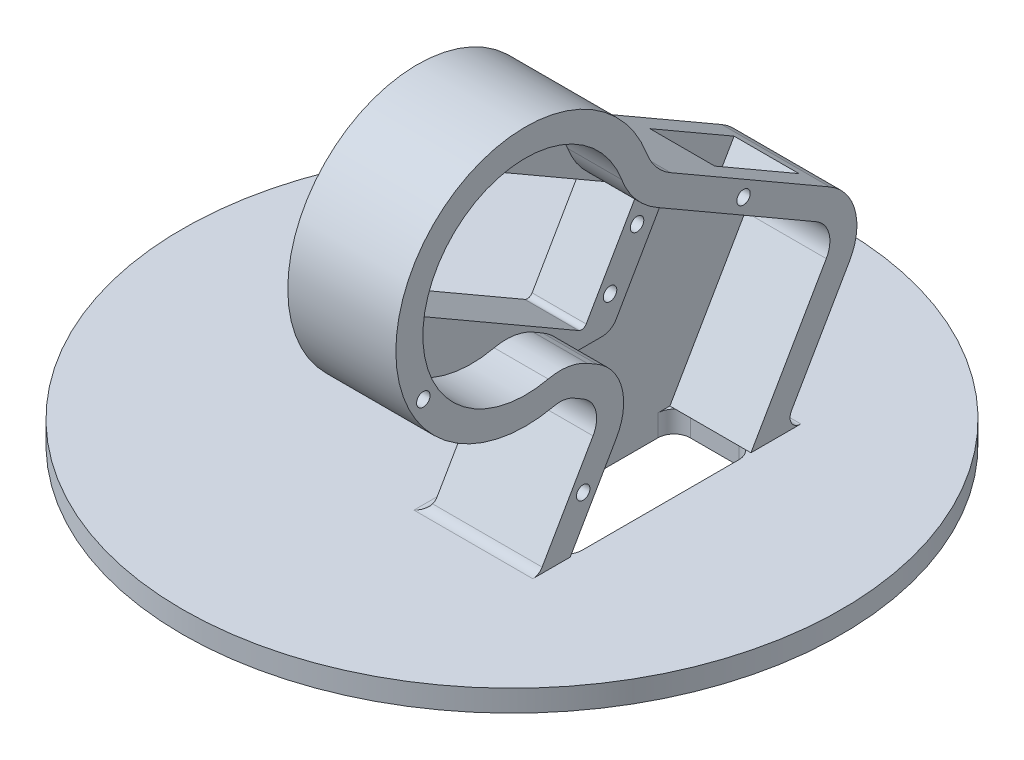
ISO-10303-21;
HEADER;
FILE_DESCRIPTION(('STEP AP214'),'2;1');
FILE_NAME('part.step','',(''),(''),'','','');
FILE_SCHEMA(('AUTOMOTIVE_DESIGN { 1 0 10303 214 1 1 1 1 }'));
ENDSEC;
DATA;
#1=APPLICATION_CONTEXT('core data for automotive mechanical design processes');
#2=APPLICATION_PROTOCOL_DEFINITION('international standard','automotive_design',2000,#1);
#3=PRODUCT_CONTEXT('',#1,'mechanical');
#4=PRODUCT('Part','Part','',(#3));
#5=PRODUCT_RELATED_PRODUCT_CATEGORY('part','',(#4));
#6=PRODUCT_DEFINITION_FORMATION('','',#4);
#7=PRODUCT_DEFINITION_CONTEXT('part definition',#1,'design');
#8=PRODUCT_DEFINITION('design','',#6,#7);
#9=PRODUCT_DEFINITION_SHAPE('','',#8);
#10=(LENGTH_UNIT() NAMED_UNIT(*) SI_UNIT(.MILLI.,.METRE.));
#11=(NAMED_UNIT(*) PLANE_ANGLE_UNIT() SI_UNIT($,.RADIAN.));
#12=(NAMED_UNIT(*) SI_UNIT($,.STERADIAN.) SOLID_ANGLE_UNIT());
#13=UNCERTAINTY_MEASURE_WITH_UNIT(LENGTH_MEASURE(1.E-05),#10,'distance_accuracy_value','');
#14=(GEOMETRIC_REPRESENTATION_CONTEXT(3) GLOBAL_UNCERTAINTY_ASSIGNED_CONTEXT((#13)) GLOBAL_UNIT_ASSIGNED_CONTEXT((#10,
#11,#12)) REPRESENTATION_CONTEXT('',''));
#15=CARTESIAN_POINT('',(0.,0.,0.));
#16=DIRECTION('',(0.,0.,1.));
#17=DIRECTION('',(1.,0.,0.));
#18=AXIS2_PLACEMENT_3D('',#15,#16,#17);
#19=CARTESIAN_POINT('',(17.5,26.650635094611,-26.3397459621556));
#20=DIRECTION('',(1.,0.,0.));
#21=DIRECTION('',(0.,0.,-1.));
#22=AXIS2_PLACEMENT_3D('',#19,#20,#21);
#23=PLANE('',#22);
#24=CARTESIAN_POINT('',(17.5,60.6950061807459,35.0573683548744));
#25=DIRECTION('',(1.,0.,0.));
#26=DIRECTION('',(0.,0.,-1.));
#27=AXIS2_PLACEMENT_3D('',#24,#25,#26);
#28=CIRCLE('',#27,1.24999999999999);
#29=CARTESIAN_POINT('',(17.5,60.6950061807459,33.8073683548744));
#30=VERTEX_POINT('',#29);
#31=EDGE_CURVE('E452',#30,#30,#28,.T.);
#32=ORIENTED_EDGE('',*,*,#31,.F.);
#33=EDGE_LOOP('',(#32));
#34=FACE_BOUND('',#33,.T.);
#35=CARTESIAN_POINT('',(17.5,52.0347521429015,40.0573683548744));
#36=DIRECTION('',(1.,0.,0.));
#37=DIRECTION('',(0.,0.,-1.));
#38=AXIS2_PLACEMENT_3D('',#35,#36,#37);
#39=CIRCLE('',#38,1.24999999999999);
#40=CARTESIAN_POINT('',(17.5,52.0347521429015,38.8073683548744));
#41=VERTEX_POINT('',#40);
#42=EDGE_CURVE('E459',#41,#41,#39,.T.);
#43=ORIENTED_EDGE('',*,*,#42,.F.);
#44=EDGE_LOOP('',(#43));
#45=FACE_BOUND('',#44,.T.);
#46=CARTESIAN_POINT('',(17.5,37.1950061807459,-5.64582562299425));
#47=DIRECTION('',(1.,0.,0.));
#48=DIRECTION('',(0.,0.,-1.));
#49=AXIS2_PLACEMENT_3D('',#46,#47,#48);
#50=CIRCLE('',#49,1.24999999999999);
#51=CARTESIAN_POINT('',(17.5,37.1950061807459,-6.89582562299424));
#52=VERTEX_POINT('',#51);
#53=EDGE_CURVE('E465',#52,#52,#50,.T.);
#54=ORIENTED_EDGE('',*,*,#53,.F.);
#55=EDGE_LOOP('',(#54));
#56=FACE_BOUND('',#55,.T.);
#57=CARTESIAN_POINT('',(17.5,28.5347521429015,-0.64582562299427));
#58=DIRECTION('',(1.,0.,0.));
#59=DIRECTION('',(0.,0.,-1.));
#60=AXIS2_PLACEMENT_3D('',#57,#58,#59);
#61=CIRCLE('',#60,1.24999999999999);
#62=CARTESIAN_POINT('',(17.5,28.5347521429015,-1.89582562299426));
#63=VERTEX_POINT('',#62);
#64=EDGE_CURVE('E471',#63,#63,#61,.T.);
#65=ORIENTED_EDGE('',*,*,#64,.F.);
#66=EDGE_LOOP('',(#65));
#67=FACE_BOUND('',#66,.T.);
#68=DIRECTION('',(0.,-0.866025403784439,0.5));
#69=VECTOR('',#68,1.);
#70=CARTESIAN_POINT('',(17.5,60.4974582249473,32.2846713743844));
#71=LINE('',#70,#69);
#72=CARTESIAN_POINT('',(17.5,63.3421204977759,30.6423048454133));
#73=VERTEX_POINT('',#72);
#74=CARTESIAN_POINT('',(17.5,46.8876378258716,40.1423048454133));
#75=VERTEX_POINT('',#74);
#76=EDGE_CURVE('E751',#73,#75,#71,.T.);
#77=ORIENTED_EDGE('',*,*,#76,.F.);
#78=CARTESIAN_POINT('',(17.5,62.8421204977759,29.7762794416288));
#79=DIRECTION('',(1.,0.,0.));
#80=DIRECTION('',(0.,0.,-1.));
#81=AXIS2_PLACEMENT_3D('',#78,#79,#80);
#82=CIRCLE('',#81,1.);
#83=CARTESIAN_POINT('',(17.5,63.7081459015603,29.2762794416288));
#84=VERTEX_POINT('',#83);
#85=EDGE_CURVE('E813',#73,#84,#82,.F.);
#86=ORIENTED_EDGE('',*,*,#85,.T.);
#87=DIRECTION('',(0.,0.5,0.866025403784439));
#88=VECTOR('',#87,1.);
#89=CARTESIAN_POINT('',(17.5,30.361322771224,-28.4821124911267));
#90=LINE('',#89,#88);
#91=CARTESIAN_POINT('',(17.5,43.7081459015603,-5.36473670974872));
#92=VERTEX_POINT('',#91);
#93=EDGE_CURVE('E742',#92,#84,#90,.T.);
#94=ORIENTED_EDGE('',*,*,#93,.F.);
#95=CARTESIAN_POINT('',(17.5,42.8421204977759,-4.86473670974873));
#96=DIRECTION('',(1.,0.,0.));
#97=DIRECTION('',(0.,0.,-1.));
#98=AXIS2_PLACEMENT_3D('',#95,#96,#97);
#99=CIRCLE('',#98,1.);
#100=CARTESIAN_POINT('',(17.5,42.3421204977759,-5.73076211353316));
#101=VERTEX_POINT('',#100);
#102=EDGE_CURVE('E809',#92,#101,#99,.F.);
#103=ORIENTED_EDGE('',*,*,#102,.T.);
#104=DIRECTION('',(0.,-0.866025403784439,0.5));
#105=VECTOR('',#104,1.);
#106=CARTESIAN_POINT('',(17.5,39.4974582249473,-4.088395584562));
#107=LINE('',#106,#105);
#108=CARTESIAN_POINT('',(17.5,25.8876378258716,3.76923788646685));
#109=VERTEX_POINT('',#108);
#110=EDGE_CURVE('E745',#101,#109,#107,.T.);
#111=ORIENTED_EDGE('',*,*,#110,.T.);
#112=CARTESIAN_POINT('',(17.5,26.3876378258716,4.63526329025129));
#113=DIRECTION('',(1.,0.,0.));
#114=DIRECTION('',(0.,0.,-1.));
#115=AXIS2_PLACEMENT_3D('',#112,#113,#114);
#116=CIRCLE('',#115,1.);
#117=CARTESIAN_POINT('',(17.5,25.5216124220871,5.13526329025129));
#118=VERTEX_POINT('',#117);
#119=EDGE_CURVE('E817',#109,#118,#116,.F.);
#120=ORIENTED_EDGE('',*,*,#119,.T.);
#121=DIRECTION('',(0.,0.5,0.866025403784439));
#122=VECTOR('',#121,1.);
#123=CARTESIAN_POINT('',(17.5,12.1747892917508,-17.9821124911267));
#124=LINE('',#123,#122);
#125=CARTESIAN_POINT('',(17.5,45.5216124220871,39.7762794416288));
#126=VERTEX_POINT('',#125);
#127=EDGE_CURVE('E748',#118,#126,#124,.T.);
#128=ORIENTED_EDGE('',*,*,#127,.T.);
#129=CARTESIAN_POINT('',(17.5,46.3876378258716,39.2762794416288));
#130=DIRECTION('',(1.,0.,0.));
#131=DIRECTION('',(0.,0.,-1.));
#132=AXIS2_PLACEMENT_3D('',#129,#130,#131);
#133=CIRCLE('',#132,1.);
#134=EDGE_CURVE('E805',#126,#75,#133,.F.);
#135=ORIENTED_EDGE('',*,*,#134,.T.);
#136=EDGE_LOOP('',(#77,#86,#94,#103,#111,#120,#128,#135));
#137=FACE_BOUND('',#136,.T.);
#138=DIRECTION('',(0.,0.,-1.));
#139=VECTOR('',#138,1.);
#140=CARTESIAN_POINT('',(17.5,22.408698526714,0.));
#141=LINE('',#140,#139);
#142=CARTESIAN_POINT('',(17.5,22.408698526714,7.17086875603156));
#143=VERTEX_POINT('',#142);
#144=CARTESIAN_POINT('',(17.5,22.408698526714,0.803425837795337));
#145=VERTEX_POINT('',#144);
#146=EDGE_CURVE('E417',#143,#145,#141,.T.);
#147=ORIENTED_EDGE('',*,*,#146,.T.);
#148=CARTESIAN_POINT('',(17.5,25.408698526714,0.803425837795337));
#149=DIRECTION('',(1.,0.,0.));
#150=DIRECTION('',(0.,0.,-1.));
#151=AXIS2_PLACEMENT_3D('',#148,#149,#150);
#152=CIRCLE('',#151,3.);
#153=CARTESIAN_POINT('',(17.5,23.908698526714,-1.79465037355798));
#154=VERTEX_POINT('',#153);
#155=EDGE_CURVE('E60',#145,#154,#152,.T.);
#156=ORIENTED_EDGE('',*,*,#155,.T.);
#157=DIRECTION('',(0.,0.866025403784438,-0.500000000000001));
#158=VECTOR('',#157,1.);
#159=CARTESIAN_POINT('',(17.5,5.2000682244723,9.00678236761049));
#160=LINE('',#159,#158);
#161=CARTESIAN_POINT('',(17.5,40.9236161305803,-11.6182176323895));
#162=VERTEX_POINT('',#161);
#163=EDGE_CURVE('E413',#154,#162,#160,.T.);
#164=ORIENTED_EDGE('',*,*,#163,.T.);
#165=DIRECTION('',(0.,0.499999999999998,0.86602540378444));
#166=VECTOR('',#165,1.);
#167=CARTESIAN_POINT('',(17.5,48.0021547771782,0.642170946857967));
#168=LINE('',#167,#166);
#169=CARTESIAN_POINT('',(17.5,40.9807621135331,-11.5192378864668));
#170=VERTEX_POINT('',#169);
#171=EDGE_CURVE('E490',#162,#170,#168,.T.);
#172=ORIENTED_EDGE('',*,*,#171,.T.);
#173=CARTESIAN_POINT('',(17.5,48.0021547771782,0.642170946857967));
#174=VERTEX_POINT('',#173);
#175=EDGE_CURVE('E489',#170,#174,#168,.T.);
#176=ORIENTED_EDGE('',*,*,#175,.T.);
#177=CARTESIAN_POINT('',(17.5,60.9925358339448,-6.85782905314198));
#178=DIRECTION('',(-1.,0.,0.));
#179=DIRECTION('',(0.,0.,-1.));
#180=AXIS2_PLACEMENT_3D('',#177,#178,#179);
#181=CIRCLE('',#180,15.);
#182=CARTESIAN_POINT('',(17.5,55.7523931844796,7.19709552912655));
#183=VERTEX_POINT('',#182);
#184=EDGE_CURVE('E493',#174,#183,#181,.T.);
#185=ORIENTED_EDGE('',*,*,#184,.T.);
#186=CARTESIAN_POINT('',(17.5,49.1148791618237,25.));
#187=DIRECTION('',(1.,0.,0.));
#188=DIRECTION('',(0.,0.,-1.));
#189=AXIS2_PLACEMENT_3D('',#186,#187,#188);
#190=CIRCLE('',#189,19.);
#191=CARTESIAN_POINT('',(17.5,30.5856392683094,20.796754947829));
#192=VERTEX_POINT('',#191);
#193=EDGE_CURVE('E496',#183,#192,#190,.T.);
#194=ORIENTED_EDGE('',*,*,#193,.T.);
#195=CARTESIAN_POINT('',(17.5,20.8334077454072,18.5845207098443));
#196=DIRECTION('',(-1.,0.,0.));
#197=DIRECTION('',(0.,0.,-1.));
#198=AXIS2_PLACEMENT_3D('',#195,#196,#197);
#199=CIRCLE('',#198,10.);
#200=CARTESIAN_POINT('',(17.5,29.4936617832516,13.5845207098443));
#201=VERTEX_POINT('',#200);
#202=EDGE_CURVE('E499',#192,#201,#199,.T.);
#203=ORIENTED_EDGE('',*,*,#202,.T.);
#204=DIRECTION('',(0.,-0.499999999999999,-0.866025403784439));
#205=VECTOR('',#204,1.);
#206=CARTESIAN_POINT('',(17.5,28.4807621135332,11.8301270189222));
#207=LINE('',#206,#205);
#208=CARTESIAN_POINT('',(17.5,28.4807621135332,11.8301270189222));
#209=VERTEX_POINT('',#208);
#210=EDGE_CURVE('E502',#201,#209,#207,.T.);
#211=ORIENTED_EDGE('',*,*,#210,.T.);
#212=CARTESIAN_POINT('',(17.5,19.8205080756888,16.8301270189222));
#213=DIRECTION('',(-1.,0.,0.));
#214=DIRECTION('',(0.,0.,-1.));
#215=AXIS2_PLACEMENT_3D('',#212,#213,#214);
#216=CIRCLE('',#215,10.);
#217=EDGE_CURVE('E505',#209,#143,#216,.T.);
#218=ORIENTED_EDGE('',*,*,#217,.T.);
#219=EDGE_LOOP('',(#147,#156,#164,#172,#176,#185,#194,#203,#211,#218));
#220=FACE_BOUND('',#219,.T.);
#221=ADVANCED_FACE('F38',(#34,#45,#56,#67,#137,#220),#23,.T.);
#222=CARTESIAN_POINT('',(27.5,26.650635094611,-26.3397459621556));
#223=DIRECTION('',(-1.,0.,0.));
#224=DIRECTION('',(0.,0.,1.));
#225=AXIS2_PLACEMENT_3D('',#222,#223,#224);
#226=PLANE('',#225);
#227=CARTESIAN_POINT('',(27.5,38.8935845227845,43.9149447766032));
#228=DIRECTION('',(1.,0.,0.));
#229=DIRECTION('',(0.,0.,-1.));
#230=AXIS2_PLACEMENT_3D('',#227,#228,#229);
#231=CIRCLE('',#230,1.24999999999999);
#232=CARTESIAN_POINT('',(27.5,38.8935845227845,42.6649447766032));
#233=VERTEX_POINT('',#232);
#234=EDGE_CURVE('E445',#233,#233,#231,.T.);
#235=ORIENTED_EDGE('',*,*,#234,.F.);
#236=EDGE_LOOP('',(#235));
#237=FACE_BOUND('',#236,.T.);
#238=CARTESIAN_POINT('',(27.5,26.650635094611,-26.3397459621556));
#239=DIRECTION('',(-1.,0.,0.));
#240=DIRECTION('',(0.,0.,1.));
#241=AXIS2_PLACEMENT_3D('',#238,#239,#240);
#242=CIRCLE('',#241,5.);
#243=CARTESIAN_POINT('',(27.5,30.9807621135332,-28.8397459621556));
#244=VERTEX_POINT('',#243);
#245=CARTESIAN_POINT('',(27.5,24.150635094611,-30.6698729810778));
#246=VERTEX_POINT('',#245);
#247=EDGE_CURVE('E638',#244,#246,#242,.T.);
#248=ORIENTED_EDGE('',*,*,#247,.T.);
#249=DIRECTION('',(0.,-0.86602540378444,0.499999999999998));
#250=VECTOR('',#249,1.);
#251=CARTESIAN_POINT('',(27.5,24.150635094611,-30.6698729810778));
#252=LINE('',#251,#250);
#253=CARTESIAN_POINT('',(27.5,0.,-16.7264973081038));
#254=VERTEX_POINT('',#253);
#255=EDGE_CURVE('E633',#246,#254,#252,.T.);
#256=ORIENTED_EDGE('',*,*,#255,.T.);
#257=DIRECTION('',(0.,0.,1.));
#258=VECTOR('',#257,1.);
#259=CARTESIAN_POINT('',(27.5,0.,-22.5));
#260=LINE('',#259,#258);
#261=CARTESIAN_POINT('',(27.5,0.,-25.9641016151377));
#262=VERTEX_POINT('',#261);
#263=EDGE_CURVE('E676',#262,#254,#260,.T.);
#264=ORIENTED_EDGE('',*,*,#263,.F.);
#265=CARTESIAN_POINT('',(27.5,2.,-25.9641016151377));
#266=DIRECTION('',(-1.,0.,0.));
#267=DIRECTION('',(0.,0.,1.));
#268=AXIS2_PLACEMENT_3D('',#265,#266,#267);
#269=CIRCLE('',#268,2.);
#270=CARTESIAN_POINT('',(27.5,3.,-24.2320508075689));
#271=VERTEX_POINT('',#270);
#272=EDGE_CURVE('E771',#262,#271,#269,.T.);
#273=ORIENTED_EDGE('',*,*,#272,.T.);
#274=DIRECTION('',(0.,-0.86602540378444,0.499999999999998));
#275=VECTOR('',#274,1.);
#276=CARTESIAN_POINT('',(27.5,0.,-22.5));
#277=LINE('',#276,#275);
#278=CARTESIAN_POINT('',(27.5,21.650635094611,-35.));
#279=VERTEX_POINT('',#278);
#280=EDGE_CURVE('E671',#279,#271,#277,.T.);
#281=ORIENTED_EDGE('',*,*,#280,.F.);
#282=CARTESIAN_POINT('',(27.5,26.650635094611,-26.3397459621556));
#283=DIRECTION('',(-1.,0.,0.));
#284=DIRECTION('',(0.,0.,1.));
#285=AXIS2_PLACEMENT_3D('',#282,#283,#284);
#286=CIRCLE('',#285,10.);
#287=CARTESIAN_POINT('',(27.5,35.3108891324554,-31.3397459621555));
#288=VERTEX_POINT('',#287);
#289=EDGE_CURVE('E698',#288,#279,#286,.T.);
#290=ORIENTED_EDGE('',*,*,#289,.F.);
#291=DIRECTION('',(0.,-0.499999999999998,-0.86602540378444));
#292=VECTOR('',#291,1.);
#293=CARTESIAN_POINT('',(27.5,35.3108891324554,-31.3397459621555));
#294=LINE('',#293,#292);
#295=CARTESIAN_POINT('',(27.5,52.3322817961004,-1.85782905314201));
#296=VERTEX_POINT('',#295);
#297=EDGE_CURVE('E695',#296,#288,#294,.T.);
#298=ORIENTED_EDGE('',*,*,#297,.F.);
#299=CARTESIAN_POINT('',(27.5,60.9925358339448,-6.85782905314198));
#300=DIRECTION('',(1.,0.,0.));
#301=DIRECTION('',(0.,0.,-1.));
#302=AXIS2_PLACEMENT_3D('',#299,#300,#301);
#303=CIRCLE('',#302,10.);
#304=CARTESIAN_POINT('',(27.5,57.499107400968,2.51212066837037));
#305=VERTEX_POINT('',#304);
#306=EDGE_CURVE('E692',#305,#296,#303,.T.);
#307=ORIENTED_EDGE('',*,*,#306,.F.);
#308=CARTESIAN_POINT('',(27.5,49.1148791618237,25.));
#309=DIRECTION('',(-1.,0.,0.));
#310=DIRECTION('',(0.,0.,1.));
#311=AXIS2_PLACEMENT_3D('',#308,#309,#310);
#312=CIRCLE('',#311,24.);
#313=CARTESIAN_POINT('',(27.5,25.7095235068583,19.6906378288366));
#314=VERTEX_POINT('',#313);
#315=EDGE_CURVE('E689',#314,#305,#312,.T.);
#316=ORIENTED_EDGE('',*,*,#315,.F.);
#317=CARTESIAN_POINT('',(27.5,20.8334077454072,18.5845207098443));
#318=DIRECTION('',(1.,0.,0.));
#319=DIRECTION('',(0.,0.,1.));
#320=AXIS2_PLACEMENT_3D('',#317,#318,#319);
#321=CIRCLE('',#320,4.99999999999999);
#322=CARTESIAN_POINT('',(27.5,25.1635347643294,16.0845207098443));
#323=VERTEX_POINT('',#322);
#324=EDGE_CURVE('E686',#323,#314,#321,.T.);
#325=ORIENTED_EDGE('',*,*,#324,.F.);
#326=DIRECTION('',(0.,0.499999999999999,0.866025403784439));
#327=VECTOR('',#326,1.);
#328=CARTESIAN_POINT('',(27.5,24.150635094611,14.3301270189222));
#329=LINE('',#328,#327);
#330=CARTESIAN_POINT('',(27.5,24.150635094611,14.3301270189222));
#331=VERTEX_POINT('',#330);
#332=EDGE_CURVE('E683',#331,#323,#329,.T.);
#333=ORIENTED_EDGE('',*,*,#332,.F.);
#334=CARTESIAN_POINT('',(27.5,19.8205080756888,16.8301270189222));
#335=DIRECTION('',(1.,0.,0.));
#336=DIRECTION('',(0.,0.,1.));
#337=AXIS2_PLACEMENT_3D('',#334,#335,#336);
#338=CIRCLE('',#337,5.);
#339=CARTESIAN_POINT('',(27.5,17.3205080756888,12.5));
#340=VERTEX_POINT('',#339);
#341=EDGE_CURVE('E680',#340,#331,#338,.T.);
#342=ORIENTED_EDGE('',*,*,#341,.F.);
#343=DIRECTION('',(0.,0.86602540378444,-0.499999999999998));
#344=VECTOR('',#343,1.);
#345=CARTESIAN_POINT('',(27.5,0.,22.5));
#346=LINE('',#345,#344);
#347=CARTESIAN_POINT('',(27.5,1.00000000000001,21.9226497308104));
#348=VERTEX_POINT('',#347);
#349=EDGE_CURVE('E678',#348,#340,#346,.T.);
#350=ORIENTED_EDGE('',*,*,#349,.F.);
#351=CARTESIAN_POINT('',(27.5,2.,23.6547005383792));
#352=DIRECTION('',(-1.,0.,0.));
#353=DIRECTION('',(0.,0.,1.));
#354=AXIS2_PLACEMENT_3D('',#351,#352,#353);
#355=CIRCLE('',#354,2.);
#356=CARTESIAN_POINT('',(27.5,0.,23.6547005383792));
#357=VERTEX_POINT('',#356);
#358=EDGE_CURVE('E773',#348,#357,#355,.T.);
#359=ORIENTED_EDGE('',*,*,#358,.T.);
#360=CARTESIAN_POINT('',(27.5,0.,16.7264973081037));
#361=VERTEX_POINT('',#360);
#362=EDGE_CURVE('E674',#361,#357,#260,.T.);
#363=ORIENTED_EDGE('',*,*,#362,.F.);
#364=DIRECTION('',(0.,0.86602540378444,-0.499999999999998));
#365=VECTOR('',#364,1.);
#366=CARTESIAN_POINT('',(27.5,38.6362066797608,-5.58012701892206));
#367=LINE('',#366,#365);
#368=CARTESIAN_POINT('',(27.5,14.8205080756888,8.16987298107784));
#369=VERTEX_POINT('',#368);
#370=EDGE_CURVE('E637',#361,#369,#367,.T.);
#371=ORIENTED_EDGE('',*,*,#370,.T.);
#372=CARTESIAN_POINT('',(27.5,19.8205080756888,16.8301270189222));
#373=DIRECTION('',(-1.,0.,0.));
#374=DIRECTION('',(0.,0.,1.));
#375=AXIS2_PLACEMENT_3D('',#372,#373,#374);
#376=CIRCLE('',#375,9.99999999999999);
#377=CARTESIAN_POINT('',(27.5,28.4807621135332,11.8301270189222));
#378=VERTEX_POINT('',#377);
#379=EDGE_CURVE('E657',#369,#378,#376,.F.);
#380=ORIENTED_EDGE('',*,*,#379,.T.);
#381=DIRECTION('',(0.,0.499999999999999,0.866025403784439));
#382=VECTOR('',#381,1.);
#383=CARTESIAN_POINT('',(27.5,11.4951905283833,-17.5897459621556));
#384=LINE('',#383,#382);
#385=CARTESIAN_POINT('',(27.5,29.4936617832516,13.5845207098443));
#386=VERTEX_POINT('',#385);
#387=EDGE_CURVE('E654',#378,#386,#384,.T.);
#388=ORIENTED_EDGE('',*,*,#387,.T.);
#389=CARTESIAN_POINT('',(27.5,20.8334077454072,18.5845207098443));
#390=DIRECTION('',(-1.,0.,0.));
#391=DIRECTION('',(0.,0.,1.));
#392=AXIS2_PLACEMENT_3D('',#389,#390,#391);
#393=CIRCLE('',#392,9.99999999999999);
#394=CARTESIAN_POINT('',(27.5,30.5856392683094,20.796754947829));
#395=VERTEX_POINT('',#394);
#396=EDGE_CURVE('E651',#386,#395,#393,.F.);
#397=ORIENTED_EDGE('',*,*,#396,.T.);
#398=CARTESIAN_POINT('',(27.5,49.1148791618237,25.));
#399=DIRECTION('',(-1.,0.,0.));
#400=DIRECTION('',(0.,0.,1.));
#401=AXIS2_PLACEMENT_3D('',#398,#399,#400);
#402=CIRCLE('',#401,19.);
#403=CARTESIAN_POINT('',(27.5,55.7523931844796,7.19709552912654));
#404=VERTEX_POINT('',#403);
#405=EDGE_CURVE('E648',#395,#404,#402,.T.);
#406=ORIENTED_EDGE('',*,*,#405,.T.);
#407=CARTESIAN_POINT('',(27.5,60.9925358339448,-6.85782905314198));
#408=DIRECTION('',(-1.,0.,0.));
#409=DIRECTION('',(0.,0.,1.));
#410=AXIS2_PLACEMENT_3D('',#407,#408,#409);
#411=CIRCLE('',#410,15.);
#412=CARTESIAN_POINT('',(27.5,48.0021547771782,0.642170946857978));
#413=VERTEX_POINT('',#412);
#414=EDGE_CURVE('E645',#404,#413,#411,.F.);
#415=ORIENTED_EDGE('',*,*,#414,.T.);
#416=DIRECTION('',(0.,-0.499999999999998,-0.86602540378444));
#417=VECTOR('',#416,1.);
#418=CARTESIAN_POINT('',(27.5,30.9807621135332,-28.8397459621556));
#419=LINE('',#418,#417);
#420=EDGE_CURVE('E642',#413,#244,#419,.T.);
#421=ORIENTED_EDGE('',*,*,#420,.T.);
#422=EDGE_LOOP('',(#248,#256,#264,#273,#281,#290,#298,#307,#316,#325,#333,#342,#350,#359,#363,
#371,#380,#388,#397,#406,#415,#421));
#423=FACE_BOUND('',#422,.T.);
#424=CARTESIAN_POINT('',(27.5,41.6565219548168,-15.3487875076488));
#425=DIRECTION('',(1.,0.,0.));
#426=DIRECTION('',(0.,0.,-1.));
#427=AXIS2_PLACEMENT_3D('',#424,#425,#426);
#428=CIRCLE('',#427,1.24999999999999);
#429=CARTESIAN_POINT('',(27.5,41.6565219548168,-16.5987875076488));
#430=VERTEX_POINT('',#429);
#431=EDGE_CURVE('E442',#430,#430,#428,.T.);
#432=ORIENTED_EDGE('',*,*,#431,.F.);
#433=EDGE_LOOP('',(#432));
#434=FACE_BOUND('',#433,.T.);
#435=CARTESIAN_POINT('',(27.5,9.16025403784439,14.3245735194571));
#436=DIRECTION('',(1.,0.,0.));
#437=DIRECTION('',(0.,0.,-1.));
#438=AXIS2_PLACEMENT_3D('',#435,#436,#437);
#439=CIRCLE('',#438,1.24999999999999);
#440=CARTESIAN_POINT('',(27.5,9.16025403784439,13.0745735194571));
#441=VERTEX_POINT('',#440);
#442=EDGE_CURVE('E419',#441,#441,#439,.T.);
#443=ORIENTED_EDGE('',*,*,#442,.F.);
#444=EDGE_LOOP('',(#443));
#445=FACE_BOUND('',#444,.T.);
#446=ADVANCED_FACE('F839',(#237,#423,#434,#445),#226,.F.);
#447=CARTESIAN_POINT('',(27.5,2.49999999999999,-18.1698729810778));
#448=DIRECTION('',(0.,-0.499999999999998,-0.86602540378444));
#449=DIRECTION('',(0.,0.86602540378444,-0.499999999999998));
#450=AXIS2_PLACEMENT_3D('',#447,#448,#449);
#451=PLANE('',#450);
#452=DIRECTION('',(-1.,0.,0.));
#453=VECTOR('',#452,1.);
#454=CARTESIAN_POINT('',(27.5,24.150635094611,-30.6698729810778));
#455=LINE('',#454,#453);
#456=CARTESIAN_POINT('',(12.5,24.150635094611,-30.6698729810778));
#457=VERTEX_POINT('',#456);
#458=EDGE_CURVE('E606',#246,#457,#455,.T.);
#459=ORIENTED_EDGE('',*,*,#458,.T.);
#460=DIRECTION('',(0.,-0.86602540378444,0.499999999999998));
#461=VECTOR('',#460,1.);
#462=CARTESIAN_POINT('',(12.5,24.150635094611,-30.6698729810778));
#463=LINE('',#462,#461);
#464=CARTESIAN_POINT('',(12.5,0.,-16.7264973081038));
#465=VERTEX_POINT('',#464);
#466=EDGE_CURVE('E602',#457,#465,#463,.T.);
#467=ORIENTED_EDGE('',*,*,#466,.T.);
#468=DIRECTION('',(-1.,0.,0.));
#469=VECTOR('',#468,1.);
#470=CARTESIAN_POINT('',(27.5,0.,-16.7264973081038));
#471=LINE('',#470,#469);
#472=CARTESIAN_POINT('',(13.4893509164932,0.,-16.7264973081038));
#473=VERTEX_POINT('',#472);
#474=EDGE_CURVE('E641',#473,#465,#471,.T.);
#475=ORIENTED_EDGE('',*,*,#474,.F.);
#476=CARTESIAN_POINT('',(26.5106490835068,0.,-16.7264973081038));
#477=VERTEX_POINT('',#476);
#478=EDGE_CURVE('E670',#477,#473,#471,.T.);
#479=ORIENTED_EDGE('',*,*,#478,.F.);
#480=EDGE_CURVE('E667',#254,#477,#471,.T.);
#481=ORIENTED_EDGE('',*,*,#480,.F.);
#482=ORIENTED_EDGE('',*,*,#255,.F.);
#483=EDGE_LOOP('',(#459,#467,#475,#479,#481,#482));
#484=FACE_BOUND('',#483,.T.);
#485=ADVANCED_FACE('F866',(#484),#451,.F.);
#486=CARTESIAN_POINT('',(12.5,26.650635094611,-26.3397459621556));
#487=DIRECTION('',(-1.,0.,0.));
#488=DIRECTION('',(0.,0.,1.));
#489=AXIS2_PLACEMENT_3D('',#486,#487,#488);
#490=PLANE('',#489);
#491=ORIENTED_EDGE('',*,*,#466,.F.);
#492=CARTESIAN_POINT('',(12.5,26.650635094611,-26.3397459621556));
#493=DIRECTION('',(-1.,0.,0.));
#494=DIRECTION('',(0.,0.,1.));
#495=AXIS2_PLACEMENT_3D('',#492,#493,#494);
#496=CIRCLE('',#495,5.);
#497=CARTESIAN_POINT('',(12.5,30.9807621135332,-28.8397459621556));
#498=VERTEX_POINT('',#497);
#499=EDGE_CURVE('E423',#457,#498,#496,.F.);
#500=ORIENTED_EDGE('',*,*,#499,.T.);
#501=DIRECTION('',(0.,0.499999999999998,0.86602540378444));
#502=VECTOR('',#501,1.);
#503=CARTESIAN_POINT('',(12.5,35.7235479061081,-20.6249999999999));
#504=LINE('',#503,#502);
#505=CARTESIAN_POINT('',(12.5,31.9807621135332,-27.1076951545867));
#506=VERTEX_POINT('',#505);
#507=EDGE_CURVE('E429',#498,#506,#504,.T.);
#508=ORIENTED_EDGE('',*,*,#507,.T.);
#509=DIRECTION('',(0.,-0.499999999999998,-0.86602540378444));
#510=VECTOR('',#509,1.);
#511=CARTESIAN_POINT('',(12.5,30.9807621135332,-28.8397459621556));
#512=LINE('',#511,#510);
#513=CARTESIAN_POINT('',(12.5,40.9236161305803,-11.6182176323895));
#514=VERTEX_POINT('',#513);
#515=EDGE_CURVE('E409',#514,#506,#512,.T.);
#516=ORIENTED_EDGE('',*,*,#515,.F.);
#517=DIRECTION('',(0.,0.866025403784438,-0.500000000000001));
#518=VECTOR('',#517,1.);
#519=CARTESIAN_POINT('',(12.5,5.2000682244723,9.00678236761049));
#520=LINE('',#519,#518);
#521=CARTESIAN_POINT('',(12.5,23.908698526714,-1.79465037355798));
#522=VERTEX_POINT('',#521);
#523=EDGE_CURVE('E424',#522,#514,#520,.T.);
#524=ORIENTED_EDGE('',*,*,#523,.F.);
#525=CARTESIAN_POINT('',(12.5,25.408698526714,0.803425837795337));
#526=DIRECTION('',(-1.,0.,0.));
#527=DIRECTION('',(0.,0.,1.));
#528=AXIS2_PLACEMENT_3D('',#525,#526,#527);
#529=CIRCLE('',#528,3.);
#530=CARTESIAN_POINT('',(12.5,22.408698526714,0.803425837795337));
#531=VERTEX_POINT('',#530);
#532=EDGE_CURVE('E11',#522,#531,#529,.T.);
#533=ORIENTED_EDGE('',*,*,#532,.T.);
#534=DIRECTION('',(0.,0.,-1.));
#535=VECTOR('',#534,1.);
#536=CARTESIAN_POINT('',(12.5,22.408698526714,0.));
#537=LINE('',#536,#535);
#538=CARTESIAN_POINT('',(12.5,22.408698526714,7.17086875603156));
#539=VERTEX_POINT('',#538);
#540=EDGE_CURVE('E425',#539,#531,#537,.T.);
#541=ORIENTED_EDGE('',*,*,#540,.F.);
#542=CARTESIAN_POINT('',(12.5,19.8205080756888,16.8301270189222));
#543=DIRECTION('',(-1.,0.,0.));
#544=DIRECTION('',(0.,0.,1.));
#545=AXIS2_PLACEMENT_3D('',#542,#543,#544);
#546=CIRCLE('',#545,10.);
#547=CARTESIAN_POINT('',(12.5,14.8205080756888,8.16987298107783));
#548=VERTEX_POINT('',#547);
#549=EDGE_CURVE('E420',#539,#548,#546,.T.);
#550=ORIENTED_EDGE('',*,*,#549,.T.);
#551=DIRECTION('',(0.,0.86602540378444,-0.499999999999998));
#552=VECTOR('',#551,1.);
#553=CARTESIAN_POINT('',(12.5,38.6362066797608,-5.58012701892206));
#554=LINE('',#553,#552);
#555=CARTESIAN_POINT('',(12.5,0.,16.7264973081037));
#556=VERTEX_POINT('',#555);
#557=EDGE_CURVE('E630',#556,#548,#554,.T.);
#558=ORIENTED_EDGE('',*,*,#557,.F.);
#559=DIRECTION('',(0.,0.,1.));
#560=VECTOR('',#559,1.);
#561=CARTESIAN_POINT('',(12.5,0.,-26.3397459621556));
#562=LINE('',#561,#560);
#563=CARTESIAN_POINT('',(12.5,0.,14.5));
#564=VERTEX_POINT('',#563);
#565=EDGE_CURVE('E605',#564,#556,#562,.T.);
#566=ORIENTED_EDGE('',*,*,#565,.F.);
#567=DIRECTION('',(0.,-1.,0.));
#568=VECTOR('',#567,1.);
#569=CARTESIAN_POINT('',(12.5,0.,14.5));
#570=LINE('',#569,#568);
#571=CARTESIAN_POINT('',(12.5,-4.,14.5));
#572=VERTEX_POINT('',#571);
#573=EDGE_CURVE('E571',#564,#572,#570,.T.);
#574=ORIENTED_EDGE('',*,*,#573,.T.);
#575=DIRECTION('',(0.,0.,1.));
#576=VECTOR('',#575,1.);
#577=CARTESIAN_POINT('',(12.5,-4.,0.));
#578=LINE('',#577,#576);
#579=CARTESIAN_POINT('',(12.5,-4.,-14.5));
#580=VERTEX_POINT('',#579);
#581=EDGE_CURVE('E526',#580,#572,#578,.T.);
#582=ORIENTED_EDGE('',*,*,#581,.F.);
#583=DIRECTION('',(0.,-1.,0.));
#584=VECTOR('',#583,1.);
#585=CARTESIAN_POINT('',(12.5,0.,-14.5));
#586=LINE('',#585,#584);
#587=CARTESIAN_POINT('',(12.5,0.,-14.5));
#588=VERTEX_POINT('',#587);
#589=EDGE_CURVE('E568',#580,#588,#586,.F.);
#590=ORIENTED_EDGE('',*,*,#589,.T.);
#591=EDGE_CURVE('E634',#465,#588,#562,.T.);
#592=ORIENTED_EDGE('',*,*,#591,.F.);
#593=EDGE_LOOP('',(#491,#500,#508,#516,#524,#533,#541,#550,#558,#566,#574,#582,#590,#592));
#594=FACE_BOUND('',#593,.T.);
#595=ADVANCED_FACE('F851',(#594),#490,.F.);
#596=CARTESIAN_POINT('',(27.5,0.,-22.5));
#597=DIRECTION('',(0.,-1.,0.));
#598=DIRECTION('',(0.,0.,-1.));
#599=AXIS2_PLACEMENT_3D('',#596,#597,#598);
#600=PLANE('',#599);
#601=DIRECTION('',(-1.,0.,0.));
#602=VECTOR('',#601,1.);
#603=CARTESIAN_POINT('',(27.5,0.,16.7264973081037));
#604=LINE('',#603,#602);
#605=CARTESIAN_POINT('',(26.5106490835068,0.,16.7264973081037));
#606=VERTEX_POINT('',#605);
#607=CARTESIAN_POINT('',(13.4893509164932,0.,16.7264973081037));
#608=VERTEX_POINT('',#607);
#609=EDGE_CURVE('E664',#606,#608,#604,.T.);
#610=ORIENTED_EDGE('',*,*,#609,.F.);
#611=CARTESIAN_POINT('',(24.5,0.,14.5));
#612=DIRECTION('',(0.,1.,0.));
#613=DIRECTION('',(0.,0.,1.));
#614=AXIS2_PLACEMENT_3D('',#611,#612,#613);
#615=CIRCLE('',#614,3.);
#616=CARTESIAN_POINT('',(24.5,0.,17.5));
#617=VERTEX_POINT('',#616);
#618=EDGE_CURVE('E585',#606,#617,#615,.F.);
#619=ORIENTED_EDGE('',*,*,#618,.T.);
#620=DIRECTION('',(-1.,0.,0.));
#621=VECTOR('',#620,1.);
#622=CARTESIAN_POINT('',(0.,0.,17.5));
#623=LINE('',#622,#621);
#624=CARTESIAN_POINT('',(15.5,0.,17.5));
#625=VERTEX_POINT('',#624);
#626=EDGE_CURVE('E533',#617,#625,#623,.T.);
#627=ORIENTED_EDGE('',*,*,#626,.T.);
#628=CARTESIAN_POINT('',(15.5,0.,14.5));
#629=DIRECTION('',(0.,1.,0.));
#630=DIRECTION('',(0.,0.,1.));
#631=AXIS2_PLACEMENT_3D('',#628,#629,#630);
#632=CIRCLE('',#631,3.);
#633=EDGE_CURVE('E588',#625,#608,#632,.F.);
#634=ORIENTED_EDGE('',*,*,#633,.T.);
#635=EDGE_LOOP('',(#610,#619,#627,#634));
#636=FACE_BOUND('',#635,.T.);
#637=ADVANCED_FACE('F968',(#636),#600,.T.);
#638=ORIENTED_EDGE('',*,*,#478,.T.);
#639=CARTESIAN_POINT('',(15.5,0.,-14.5));
#640=DIRECTION('',(0.,1.,0.));
#641=DIRECTION('',(0.,0.,1.));
#642=AXIS2_PLACEMENT_3D('',#639,#640,#641);
#643=CIRCLE('',#642,3.);
#644=CARTESIAN_POINT('',(15.5,0.,-17.5));
#645=VERTEX_POINT('',#644);
#646=EDGE_CURVE('E603',#473,#645,#643,.F.);
#647=ORIENTED_EDGE('',*,*,#646,.T.);
#648=DIRECTION('',(-1.,0.,0.));
#649=VECTOR('',#648,1.);
#650=CARTESIAN_POINT('',(0.,0.,-17.5));
#651=LINE('',#650,#649);
#652=CARTESIAN_POINT('',(24.5,0.,-17.5));
#653=VERTEX_POINT('',#652);
#654=EDGE_CURVE('E527',#653,#645,#651,.T.);
#655=ORIENTED_EDGE('',*,*,#654,.F.);
#656=CARTESIAN_POINT('',(24.5,0.,-14.5));
#657=DIRECTION('',(0.,1.,0.));
#658=DIRECTION('',(0.,0.,1.));
#659=AXIS2_PLACEMENT_3D('',#656,#657,#658);
#660=CIRCLE('',#659,3.);
#661=EDGE_CURVE('E594',#653,#477,#660,.F.);
#662=ORIENTED_EDGE('',*,*,#661,.T.);
#663=EDGE_LOOP('',(#638,#647,#655,#662));
#664=FACE_BOUND('',#663,.T.);
#665=ADVANCED_FACE('F1006',(#664),#600,.T.);
#666=CARTESIAN_POINT('',(27.5,0.,-22.5));
#667=DIRECTION('',(0.,-0.499999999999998,-0.86602540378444));
#668=DIRECTION('',(0.,0.86602540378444,-0.499999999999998));
#669=AXIS2_PLACEMENT_3D('',#666,#667,#668);
#670=PLANE('',#669);
#671=ORIENTED_EDGE('',*,*,#280,.T.);
#672=DIRECTION('',(-1.,0.,0.));
#673=VECTOR('',#672,1.);
#674=CARTESIAN_POINT('',(7.5,3.,-24.2320508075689));
#675=LINE('',#674,#673);
#676=CARTESIAN_POINT('',(7.5,3.,-24.2320508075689));
#677=VERTEX_POINT('',#676);
#678=EDGE_CURVE('E754',#271,#677,#675,.T.);
#679=ORIENTED_EDGE('',*,*,#678,.T.);
#680=DIRECTION('',(0.,-0.86602540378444,0.499999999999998));
#681=VECTOR('',#680,1.);
#682=CARTESIAN_POINT('',(7.5,0.,-22.5));
#683=LINE('',#682,#681);
#684=CARTESIAN_POINT('',(7.5,21.650635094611,-35.));
#685=VERTEX_POINT('',#684);
#686=EDGE_CURVE('E609',#685,#677,#683,.T.);
#687=ORIENTED_EDGE('',*,*,#686,.F.);
#688=DIRECTION('',(-1.,0.,0.));
#689=VECTOR('',#688,1.);
#690=CARTESIAN_POINT('',(27.5,21.650635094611,-35.));
#691=LINE('',#690,#689);
#692=EDGE_CURVE('E726',#279,#685,#691,.T.);
#693=ORIENTED_EDGE('',*,*,#692,.F.);
#694=EDGE_LOOP('',(#671,#679,#687,#693));
#695=FACE_BOUND('',#694,.T.);
#696=ADVANCED_FACE('F977',(#695),#670,.T.);
#697=CARTESIAN_POINT('',(27.5,26.650635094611,-26.3397459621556));
#698=DIRECTION('',(-1.,0.,0.));
#699=DIRECTION('',(0.,0.,1.));
#700=AXIS2_PLACEMENT_3D('',#697,#698,#699);
#701=CYLINDRICAL_SURFACE('',#700,10.);
#702=CARTESIAN_POINT('',(7.5,26.650635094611,-26.3397459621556));
#703=DIRECTION('',(-1.,0.,0.));
#704=DIRECTION('',(0.,0.,1.));
#705=AXIS2_PLACEMENT_3D('',#702,#703,#704);
#706=CIRCLE('',#705,10.);
#707=CARTESIAN_POINT('',(7.5,35.3108891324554,-31.3397459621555));
#708=VERTEX_POINT('',#707);
#709=EDGE_CURVE('E675',#708,#685,#706,.T.);
#710=ORIENTED_EDGE('',*,*,#709,.F.);
#711=DIRECTION('',(-1.,0.,0.));
#712=VECTOR('',#711,1.);
#713=CARTESIAN_POINT('',(27.5,35.3108891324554,-31.3397459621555));
#714=LINE('',#713,#712);
#715=EDGE_CURVE('E728',#288,#708,#714,.T.);
#716=ORIENTED_EDGE('',*,*,#715,.F.);
#717=ORIENTED_EDGE('',*,*,#289,.T.);
#718=ORIENTED_EDGE('',*,*,#692,.T.);
#719=EDGE_LOOP('',(#710,#716,#717,#718));
#720=FACE_BOUND('',#719,.T.);
#721=ADVANCED_FACE('F974',(#720),#701,.T.);
#722=CARTESIAN_POINT('',(27.5,35.3108891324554,-31.3397459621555));
#723=DIRECTION('',(0.,0.86602540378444,-0.499999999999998));
#724=DIRECTION('',(0.,0.499999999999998,0.86602540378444));
#725=AXIS2_PLACEMENT_3D('',#722,#723,#724);
#726=PLANE('',#725);
#727=DIRECTION('',(0.,-0.499999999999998,-0.86602540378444));
#728=VECTOR('',#727,1.);
#729=CARTESIAN_POINT('',(23.5,36.3108891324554,-29.6076951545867));
#730=LINE('',#729,#728);
#731=CARTESIAN_POINT('',(23.5,45.3108891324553,-14.0192378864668));
#732=VERTEX_POINT('',#731);
#733=CARTESIAN_POINT('',(23.5,36.3108891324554,-29.6076951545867));
#734=VERTEX_POINT('',#733);
#735=EDGE_CURVE('E393',#732,#734,#730,.T.);
#736=ORIENTED_EDGE('',*,*,#735,.F.);
#737=DIRECTION('',(1.,0.,0.));
#738=VECTOR('',#737,1.);
#739=CARTESIAN_POINT('',(11.5,45.3108891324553,-14.0192378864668));
#740=LINE('',#739,#738);
#741=CARTESIAN_POINT('',(11.5,45.3108891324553,-14.0192378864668));
#742=VERTEX_POINT('',#741);
#743=EDGE_CURVE('E398',#742,#732,#740,.T.);
#744=ORIENTED_EDGE('',*,*,#743,.F.);
#745=DIRECTION('',(0.,0.499999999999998,0.86602540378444));
#746=VECTOR('',#745,1.);
#747=CARTESIAN_POINT('',(11.5,36.3108891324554,-29.6076951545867));
#748=LINE('',#747,#746);
#749=CARTESIAN_POINT('',(11.5,36.3108891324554,-29.6076951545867));
#750=VERTEX_POINT('',#749);
#751=EDGE_CURVE('E376',#750,#742,#748,.T.);
#752=ORIENTED_EDGE('',*,*,#751,.F.);
#753=DIRECTION('',(-1.,0.,0.));
#754=VECTOR('',#753,1.);
#755=CARTESIAN_POINT('',(11.5,36.3108891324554,-29.6076951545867));
#756=LINE('',#755,#754);
#757=EDGE_CURVE('E388',#734,#750,#756,.T.);
#758=ORIENTED_EDGE('',*,*,#757,.F.);
#759=EDGE_LOOP('',(#736,#744,#752,#758));
#760=FACE_BOUND('',#759,.T.);
#761=DIRECTION('',(0.,-0.499999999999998,-0.86602540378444));
#762=VECTOR('',#761,1.);
#763=CARTESIAN_POINT('',(7.5,35.3108891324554,-31.3397459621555));
#764=LINE('',#763,#762);
#765=CARTESIAN_POINT('',(7.5,52.3322817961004,-1.85782905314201));
#766=VERTEX_POINT('',#765);
#767=EDGE_CURVE('E721',#766,#708,#764,.T.);
#768=ORIENTED_EDGE('',*,*,#767,.F.);
#769=DIRECTION('',(-1.,0.,0.));
#770=VECTOR('',#769,1.);
#771=CARTESIAN_POINT('',(27.5,52.3322817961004,-1.85782905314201));
#772=LINE('',#771,#770);
#773=EDGE_CURVE('E730',#296,#766,#772,.T.);
#774=ORIENTED_EDGE('',*,*,#773,.F.);
#775=ORIENTED_EDGE('',*,*,#297,.T.);
#776=ORIENTED_EDGE('',*,*,#715,.T.);
#777=EDGE_LOOP('',(#768,#774,#775,#776));
#778=FACE_BOUND('',#777,.T.);
#779=ADVANCED_FACE('F395',(#760,#778),#726,.T.);
#780=CARTESIAN_POINT('',(27.5,60.9925358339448,-6.85782905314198));
#781=DIRECTION('',(-1.,0.,0.));
#782=DIRECTION('',(0.,0.,1.));
#783=AXIS2_PLACEMENT_3D('',#780,#781,#782);
#784=CYLINDRICAL_SURFACE('',#783,10.);
#785=CARTESIAN_POINT('',(7.5,60.9925358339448,-6.85782905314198));
#786=DIRECTION('',(1.,0.,0.));
#787=DIRECTION('',(0.,0.,-1.));
#788=AXIS2_PLACEMENT_3D('',#785,#786,#787);
#789=CIRCLE('',#788,10.);
#790=CARTESIAN_POINT('',(7.5,57.499107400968,2.51212066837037));
#791=VERTEX_POINT('',#790);
#792=EDGE_CURVE('E718',#791,#766,#789,.T.);
#793=ORIENTED_EDGE('',*,*,#792,.F.);
#794=DIRECTION('',(-1.,0.,0.));
#795=VECTOR('',#794,1.);
#796=CARTESIAN_POINT('',(27.5,57.499107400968,2.51212066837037));
#797=LINE('',#796,#795);
#798=EDGE_CURVE('E732',#305,#791,#797,.T.);
#799=ORIENTED_EDGE('',*,*,#798,.F.);
#800=ORIENTED_EDGE('',*,*,#306,.T.);
#801=ORIENTED_EDGE('',*,*,#773,.T.);
#802=EDGE_LOOP('',(#793,#799,#800,#801));
#803=FACE_BOUND('',#802,.T.);
#804=ADVANCED_FACE('F981',(#803),#784,.F.);
#805=CARTESIAN_POINT('',(27.5,49.1148791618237,25.));
#806=DIRECTION('',(-1.,0.,0.));
#807=DIRECTION('',(0.,0.,1.));
#808=AXIS2_PLACEMENT_3D('',#805,#806,#807);
#809=CYLINDRICAL_SURFACE('',#808,24.);
#810=CARTESIAN_POINT('',(7.5,49.1148791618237,25.));
#811=DIRECTION('',(-1.,0.,0.));
#812=DIRECTION('',(0.,0.,1.));
#813=AXIS2_PLACEMENT_3D('',#810,#811,#812);
#814=CIRCLE('',#813,24.);
#815=CARTESIAN_POINT('',(7.5,25.7095235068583,19.6906378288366));
#816=VERTEX_POINT('',#815);
#817=EDGE_CURVE('E715',#816,#791,#814,.T.);
#818=ORIENTED_EDGE('',*,*,#817,.F.);
#819=DIRECTION('',(-1.,0.,0.));
#820=VECTOR('',#819,1.);
#821=CARTESIAN_POINT('',(27.5,25.7095235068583,19.6906378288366));
#822=LINE('',#821,#820);
#823=EDGE_CURVE('E734',#314,#816,#822,.T.);
#824=ORIENTED_EDGE('',*,*,#823,.F.);
#825=ORIENTED_EDGE('',*,*,#315,.T.);
#826=ORIENTED_EDGE('',*,*,#798,.T.);
#827=EDGE_LOOP('',(#818,#824,#825,#826));
#828=FACE_BOUND('',#827,.T.);
#829=ADVANCED_FACE('F984',(#828),#809,.T.);
#830=CARTESIAN_POINT('',(27.5,20.8334077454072,18.5845207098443));
#831=DIRECTION('',(-1.,0.,0.));
#832=DIRECTION('',(0.,0.,1.));
#833=AXIS2_PLACEMENT_3D('',#830,#831,#832);
#834=CYLINDRICAL_SURFACE('',#833,4.99999999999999);
#835=CARTESIAN_POINT('',(7.5,20.8334077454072,18.5845207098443));
#836=DIRECTION('',(1.,0.,0.));
#837=DIRECTION('',(0.,0.,1.));
#838=AXIS2_PLACEMENT_3D('',#835,#836,#837);
#839=CIRCLE('',#838,4.99999999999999);
#840=CARTESIAN_POINT('',(7.5,25.1635347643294,16.0845207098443));
#841=VERTEX_POINT('',#840);
#842=EDGE_CURVE('E712',#841,#816,#839,.T.);
#843=ORIENTED_EDGE('',*,*,#842,.F.);
#844=DIRECTION('',(-1.,0.,0.));
#845=VECTOR('',#844,1.);
#846=CARTESIAN_POINT('',(27.5,25.1635347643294,16.0845207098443));
#847=LINE('',#846,#845);
#848=EDGE_CURVE('E736',#323,#841,#847,.T.);
#849=ORIENTED_EDGE('',*,*,#848,.F.);
#850=ORIENTED_EDGE('',*,*,#324,.T.);
#851=ORIENTED_EDGE('',*,*,#823,.T.);
#852=EDGE_LOOP('',(#843,#849,#850,#851));
#853=FACE_BOUND('',#852,.T.);
#854=ADVANCED_FACE('F988',(#853),#834,.F.);
#855=CARTESIAN_POINT('',(27.5,24.150635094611,14.3301270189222));
#856=DIRECTION('',(0.,-0.866025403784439,0.499999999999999));
#857=DIRECTION('',(0.,-0.499999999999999,-0.866025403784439));
#858=AXIS2_PLACEMENT_3D('',#855,#856,#857);
#859=PLANE('',#858);
#860=DIRECTION('',(0.,0.499999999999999,0.866025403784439));
#861=VECTOR('',#860,1.);
#862=CARTESIAN_POINT('',(7.5,24.150635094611,14.3301270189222));
#863=LINE('',#862,#861);
#864=CARTESIAN_POINT('',(7.5,24.150635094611,14.3301270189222));
#865=VERTEX_POINT('',#864);
#866=EDGE_CURVE('E709',#865,#841,#863,.T.);
#867=ORIENTED_EDGE('',*,*,#866,.F.);
#868=DIRECTION('',(-1.,0.,0.));
#869=VECTOR('',#868,1.);
#870=CARTESIAN_POINT('',(27.5,24.150635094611,14.3301270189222));
#871=LINE('',#870,#869);
#872=EDGE_CURVE('E738',#331,#865,#871,.T.);
#873=ORIENTED_EDGE('',*,*,#872,.F.);
#874=ORIENTED_EDGE('',*,*,#332,.T.);
#875=ORIENTED_EDGE('',*,*,#848,.T.);
#876=EDGE_LOOP('',(#867,#873,#874,#875));
#877=FACE_BOUND('',#876,.T.);
#878=ADVANCED_FACE('F992',(#877),#859,.T.);
#879=CARTESIAN_POINT('',(27.5,19.8205080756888,16.8301270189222));
#880=DIRECTION('',(-1.,0.,0.));
#881=DIRECTION('',(0.,0.,1.));
#882=AXIS2_PLACEMENT_3D('',#879,#880,#881);
#883=CYLINDRICAL_SURFACE('',#882,5.);
#884=CARTESIAN_POINT('',(7.5,19.8205080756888,16.8301270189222));
#885=DIRECTION('',(1.,0.,0.));
#886=DIRECTION('',(0.,0.,1.));
#887=AXIS2_PLACEMENT_3D('',#884,#885,#886);
#888=CIRCLE('',#887,5.);
#889=CARTESIAN_POINT('',(7.5,17.3205080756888,12.5));
#890=VERTEX_POINT('',#889);
#891=EDGE_CURVE('E706',#890,#865,#888,.T.);
#892=ORIENTED_EDGE('',*,*,#891,.F.);
#893=DIRECTION('',(-1.,0.,0.));
#894=VECTOR('',#893,1.);
#895=CARTESIAN_POINT('',(27.5,17.3205080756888,12.5));
#896=LINE('',#895,#894);
#897=EDGE_CURVE('E701',#340,#890,#896,.T.);
#898=ORIENTED_EDGE('',*,*,#897,.F.);
#899=ORIENTED_EDGE('',*,*,#341,.T.);
#900=ORIENTED_EDGE('',*,*,#872,.T.);
#901=EDGE_LOOP('',(#892,#898,#899,#900));
#902=FACE_BOUND('',#901,.T.);
#903=ADVANCED_FACE('F996',(#902),#883,.F.);
#904=CARTESIAN_POINT('',(27.5,0.,22.5));
#905=DIRECTION('',(0.,0.499999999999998,0.86602540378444));
#906=DIRECTION('',(0.,-0.86602540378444,0.499999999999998));
#907=AXIS2_PLACEMENT_3D('',#904,#905,#906);
#908=PLANE('',#907);
#909=DIRECTION('',(0.,0.86602540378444,-0.499999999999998));
#910=VECTOR('',#909,1.);
#911=CARTESIAN_POINT('',(7.5,0.,22.5));
#912=LINE('',#911,#910);
#913=CARTESIAN_POINT('',(7.5,2.,21.3452994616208));
#914=VERTEX_POINT('',#913);
#915=EDGE_CURVE('E704',#914,#890,#912,.T.);
#916=ORIENTED_EDGE('',*,*,#915,.F.);
#917=CARTESIAN_POINT('',(5.5,2.,21.3452994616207));
#918=DIRECTION('',(0.,0.499999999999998,0.86602540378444));
#919=DIRECTION('',(0.,0.86602540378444,-0.499999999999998));
#920=AXIS2_PLACEMENT_3D('',#917,#918,#919);
#921=ELLIPSE('',#920,2.3094010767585,2.);
#922=CARTESIAN_POINT('',(7.23205080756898,1.00000000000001,21.9226497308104));
#923=VERTEX_POINT('',#922);
#924=EDGE_CURVE('E776',#914,#923,#921,.F.);
#925=ORIENTED_EDGE('',*,*,#924,.T.);
#926=DIRECTION('',(-1.,0.,0.));
#927=VECTOR('',#926,1.);
#928=CARTESIAN_POINT('',(27.5,1.00000000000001,21.9226497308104));
#929=LINE('',#928,#927);
#930=EDGE_CURVE('E764',#923,#348,#929,.F.);
#931=ORIENTED_EDGE('',*,*,#930,.T.);
#932=ORIENTED_EDGE('',*,*,#349,.T.);
#933=ORIENTED_EDGE('',*,*,#897,.T.);
#934=EDGE_LOOP('',(#916,#925,#931,#932,#933));
#935=FACE_BOUND('',#934,.T.);
#936=ADVANCED_FACE('F972',(#935),#908,.T.);
#937=CARTESIAN_POINT('',(7.5,26.650635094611,-26.3397459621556));
#938=DIRECTION('',(-1.,0.,0.));
#939=DIRECTION('',(0.,0.,1.));
#940=AXIS2_PLACEMENT_3D('',#937,#938,#939);
#941=PLANE('',#940);
#942=DIRECTION('',(0.,0.866025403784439,-0.5));
#943=VECTOR('',#942,1.);
#944=CARTESIAN_POINT('',(7.5,60.4974582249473,32.2846713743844));
#945=LINE('',#944,#943);
#946=CARTESIAN_POINT('',(7.5,46.8876378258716,40.1423048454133));
#947=VERTEX_POINT('',#946);
#948=CARTESIAN_POINT('',(7.5,63.3421204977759,30.6423048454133));
#949=VERTEX_POINT('',#948);
#950=EDGE_CURVE('E486',#947,#949,#945,.T.);
#951=ORIENTED_EDGE('',*,*,#950,.F.);
#952=CARTESIAN_POINT('',(7.50000000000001,46.3876378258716,39.2762794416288));
#953=DIRECTION('',(-1.,0.,0.));
#954=DIRECTION('',(0.,0.,1.));
#955=AXIS2_PLACEMENT_3D('',#952,#953,#954);
#956=CIRCLE('',#955,1.);
#957=CARTESIAN_POINT('',(7.5,45.5216124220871,39.7762794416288));
#958=VERTEX_POINT('',#957);
#959=EDGE_CURVE('E803',#947,#958,#956,.F.);
#960=ORIENTED_EDGE('',*,*,#959,.T.);
#961=DIRECTION('',(0.,-0.5,-0.866025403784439));
#962=VECTOR('',#961,1.);
#963=CARTESIAN_POINT('',(7.5,12.1747892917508,-17.9821124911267));
#964=LINE('',#963,#962);
#965=CARTESIAN_POINT('',(7.5,25.5216124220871,5.13526329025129));
#966=VERTEX_POINT('',#965);
#967=EDGE_CURVE('E483',#958,#966,#964,.T.);
#968=ORIENTED_EDGE('',*,*,#967,.T.);
#969=CARTESIAN_POINT('',(7.50000000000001,26.3876378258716,4.63526329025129));
#970=DIRECTION('',(-1.,0.,0.));
#971=DIRECTION('',(0.,0.,1.));
#972=AXIS2_PLACEMENT_3D('',#969,#970,#971);
#973=CIRCLE('',#972,1.);
#974=CARTESIAN_POINT('',(7.5,25.8876378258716,3.76923788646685));
#975=VERTEX_POINT('',#974);
#976=EDGE_CURVE('E815',#966,#975,#973,.F.);
#977=ORIENTED_EDGE('',*,*,#976,.T.);
#978=DIRECTION('',(0.,0.866025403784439,-0.5));
#979=VECTOR('',#978,1.);
#980=CARTESIAN_POINT('',(7.5,39.4974582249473,-4.088395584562));
#981=LINE('',#980,#979);
#982=CARTESIAN_POINT('',(7.5,42.3421204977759,-5.73076211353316));
#983=VERTEX_POINT('',#982);
#984=EDGE_CURVE('E480',#975,#983,#981,.T.);
#985=ORIENTED_EDGE('',*,*,#984,.T.);
#986=CARTESIAN_POINT('',(7.50000000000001,42.8421204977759,-4.86473670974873));
#987=DIRECTION('',(-1.,0.,0.));
#988=DIRECTION('',(0.,0.,1.));
#989=AXIS2_PLACEMENT_3D('',#986,#987,#988);
#990=CIRCLE('',#989,1.);
#991=CARTESIAN_POINT('',(7.5,43.7081459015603,-5.36473670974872));
#992=VERTEX_POINT('',#991);
#993=EDGE_CURVE('E807',#983,#992,#990,.F.);
#994=ORIENTED_EDGE('',*,*,#993,.T.);
#995=DIRECTION('',(0.,-0.5,-0.866025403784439));
#996=VECTOR('',#995,1.);
#997=CARTESIAN_POINT('',(7.5,30.361322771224,-28.4821124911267));
#998=LINE('',#997,#996);
#999=CARTESIAN_POINT('',(7.5,63.7081459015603,29.2762794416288));
#1000=VERTEX_POINT('',#999);
#1001=EDGE_CURVE('E477',#1000,#992,#998,.T.);
#1002=ORIENTED_EDGE('',*,*,#1001,.F.);
#1003=CARTESIAN_POINT('',(7.50000000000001,62.8421204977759,29.7762794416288));
#1004=DIRECTION('',(-1.,0.,0.));
#1005=DIRECTION('',(0.,0.,1.));
#1006=AXIS2_PLACEMENT_3D('',#1003,#1004,#1005);
#1007=CIRCLE('',#1006,1.);
#1008=EDGE_CURVE('E811',#1000,#949,#1007,.F.);
#1009=ORIENTED_EDGE('',*,*,#1008,.T.);
#1010=EDGE_LOOP('',(#951,#960,#968,#977,#985,#994,#1002,#1009));
#1011=FACE_BOUND('',#1010,.T.);
#1012=CARTESIAN_POINT('',(7.5,2.,-25.9641016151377));
#1013=DIRECTION('',(-1.,0.,0.));
#1014=DIRECTION('',(0.,0.,1.));
#1015=AXIS2_PLACEMENT_3D('',#1012,#1013,#1014);
#1016=CIRCLE('',#1015,2.);
#1017=CARTESIAN_POINT('',(7.5,2.,-23.9641016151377));
#1018=VERTEX_POINT('',#1017);
#1019=EDGE_CURVE('E768',#677,#1018,#1016,.F.);
#1020=ORIENTED_EDGE('',*,*,#1019,.T.);
#1021=DIRECTION('',(0.,0.,1.));
#1022=VECTOR('',#1021,1.);
#1023=CARTESIAN_POINT('',(7.5,2.,22.5));
#1024=LINE('',#1023,#1022);
#1025=EDGE_CURVE('E766',#1018,#914,#1024,.T.);
#1026=ORIENTED_EDGE('',*,*,#1025,.T.);
#1027=ORIENTED_EDGE('',*,*,#915,.T.);
#1028=ORIENTED_EDGE('',*,*,#891,.T.);
#1029=ORIENTED_EDGE('',*,*,#866,.T.);
#1030=ORIENTED_EDGE('',*,*,#842,.T.);
#1031=ORIENTED_EDGE('',*,*,#817,.T.);
#1032=ORIENTED_EDGE('',*,*,#792,.T.);
#1033=ORIENTED_EDGE('',*,*,#767,.T.);
#1034=ORIENTED_EDGE('',*,*,#709,.T.);
#1035=ORIENTED_EDGE('',*,*,#686,.T.);
#1036=EDGE_LOOP('',(#1020,#1026,#1027,#1028,#1029,#1030,#1031,#1032,#1033,#1034,#1035));
#1037=FACE_BOUND('',#1036,.T.);
#1038=ADVANCED_FACE('F944',(#1011,#1037),#941,.T.);
#1039=CARTESIAN_POINT('',(27.5,26.650635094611,-26.3397459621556));
#1040=DIRECTION('',(-1.,0.,0.));
#1041=DIRECTION('',(0.,0.,1.));
#1042=AXIS2_PLACEMENT_3D('',#1039,#1040,#1041);
#1043=CYLINDRICAL_SURFACE('',#1042,5.);
#1044=DIRECTION('',(1.,0.,0.));
#1045=VECTOR('',#1044,1.);
#1046=CARTESIAN_POINT('',(27.5,30.9807621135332,-28.8397459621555));
#1047=LINE('',#1046,#1045);
#1048=EDGE_CURVE('E610',#244,#498,#1047,.F.);
#1049=ORIENTED_EDGE('',*,*,#1048,.T.);
#1050=ORIENTED_EDGE('',*,*,#499,.F.);
#1051=ORIENTED_EDGE('',*,*,#458,.F.);
#1052=ORIENTED_EDGE('',*,*,#247,.F.);
#1053=EDGE_LOOP('',(#1049,#1050,#1051,#1052));
#1054=FACE_BOUND('',#1053,.T.);
#1055=ADVANCED_FACE('F940',(#1054),#1043,.F.);
#1056=CARTESIAN_POINT('',(27.5,30.9807621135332,-28.8397459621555));
#1057=DIRECTION('',(0.,0.86602540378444,-0.499999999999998));
#1058=DIRECTION('',(0.,0.499999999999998,0.86602540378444));
#1059=AXIS2_PLACEMENT_3D('',#1056,#1057,#1058);
#1060=PLANE('',#1059);
#1061=ORIENTED_EDGE('',*,*,#175,.F.);
#1062=DIRECTION('',(-1.,0.,0.));
#1063=VECTOR('',#1062,1.);
#1064=CARTESIAN_POINT('',(11.5,40.9807621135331,-11.5192378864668));
#1065=LINE('',#1064,#1063);
#1066=CARTESIAN_POINT('',(23.5,40.9807621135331,-11.5192378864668));
#1067=VERTEX_POINT('',#1066);
#1068=EDGE_CURVE('E1151',#1067,#170,#1065,.T.);
#1069=ORIENTED_EDGE('',*,*,#1068,.F.);
#1070=DIRECTION('',(0.,0.499999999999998,0.86602540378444));
#1071=VECTOR('',#1070,1.);
#1072=CARTESIAN_POINT('',(23.5,31.9807621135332,-27.1076951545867));
#1073=LINE('',#1072,#1071);
#1074=CARTESIAN_POINT('',(23.5,31.9807621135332,-27.1076951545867));
#1075=VERTEX_POINT('',#1074);
#1076=EDGE_CURVE('E1150',#1075,#1067,#1073,.T.);
#1077=ORIENTED_EDGE('',*,*,#1076,.F.);
#1078=DIRECTION('',(1.,0.,0.));
#1079=VECTOR('',#1078,1.);
#1080=CARTESIAN_POINT('',(11.5,31.9807621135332,-27.1076951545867));
#1081=LINE('',#1080,#1079);
#1082=EDGE_CURVE('E410',#506,#1075,#1081,.T.);
#1083=ORIENTED_EDGE('',*,*,#1082,.F.);
#1084=ORIENTED_EDGE('',*,*,#507,.F.);
#1085=ORIENTED_EDGE('',*,*,#1048,.F.);
#1086=ORIENTED_EDGE('',*,*,#420,.F.);
#1087=DIRECTION('',(-1.,0.,0.));
#1088=VECTOR('',#1087,1.);
#1089=CARTESIAN_POINT('',(27.5,48.0021547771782,0.642170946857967));
#1090=LINE('',#1089,#1088);
#1091=EDGE_CURVE('E612',#413,#174,#1090,.T.);
#1092=ORIENTED_EDGE('',*,*,#1091,.T.);
#1093=EDGE_LOOP('',(#1061,#1069,#1077,#1083,#1084,#1085,#1086,#1092));
#1094=FACE_BOUND('',#1093,.T.);
#1095=ADVANCED_FACE('F943',(#1094),#1060,.F.);
#1096=CARTESIAN_POINT('',(27.5,60.9925358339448,-6.85782905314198));
#1097=DIRECTION('',(-1.,0.,0.));
#1098=DIRECTION('',(0.,0.,1.));
#1099=AXIS2_PLACEMENT_3D('',#1096,#1097,#1098);
#1100=CYLINDRICAL_SURFACE('',#1099,15.);
#1101=DIRECTION('',(-1.,0.,0.));
#1102=VECTOR('',#1101,1.);
#1103=CARTESIAN_POINT('',(27.5,55.7523931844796,7.19709552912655));
#1104=LINE('',#1103,#1102);
#1105=EDGE_CURVE('E615',#404,#183,#1104,.T.);
#1106=ORIENTED_EDGE('',*,*,#1105,.T.);
#1107=ORIENTED_EDGE('',*,*,#184,.F.);
#1108=ORIENTED_EDGE('',*,*,#1091,.F.);
#1109=ORIENTED_EDGE('',*,*,#414,.F.);
#1110=EDGE_LOOP('',(#1106,#1107,#1108,#1109));
#1111=FACE_BOUND('',#1110,.T.);
#1112=ADVANCED_FACE('F948',(#1111),#1100,.T.);
#1113=CARTESIAN_POINT('',(27.5,49.1148791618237,25.));
#1114=DIRECTION('',(-1.,0.,0.));
#1115=DIRECTION('',(0.,0.,1.));
#1116=AXIS2_PLACEMENT_3D('',#1113,#1114,#1115);
#1117=CYLINDRICAL_SURFACE('',#1116,19.);
#1118=DIRECTION('',(-1.,0.,0.));
#1119=VECTOR('',#1118,1.);
#1120=CARTESIAN_POINT('',(27.5,30.5856392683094,20.796754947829));
#1121=LINE('',#1120,#1119);
#1122=EDGE_CURVE('E618',#395,#192,#1121,.T.);
#1123=ORIENTED_EDGE('',*,*,#1122,.T.);
#1124=ORIENTED_EDGE('',*,*,#193,.F.);
#1125=ORIENTED_EDGE('',*,*,#1105,.F.);
#1126=ORIENTED_EDGE('',*,*,#405,.F.);
#1127=EDGE_LOOP('',(#1123,#1124,#1125,#1126));
#1128=FACE_BOUND('',#1127,.T.);
#1129=ADVANCED_FACE('F952',(#1128),#1117,.F.);
#1130=CARTESIAN_POINT('',(27.5,20.8334077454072,18.5845207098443));
#1131=DIRECTION('',(-1.,0.,0.));
#1132=DIRECTION('',(0.,0.,1.));
#1133=AXIS2_PLACEMENT_3D('',#1130,#1131,#1132);
#1134=CYLINDRICAL_SURFACE('',#1133,9.99999999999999);
#1135=DIRECTION('',(1.,0.,0.));
#1136=VECTOR('',#1135,1.);
#1137=CARTESIAN_POINT('',(27.5,29.4936617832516,13.5845207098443));
#1138=LINE('',#1137,#1136);
#1139=EDGE_CURVE('E621',#386,#201,#1138,.F.);
#1140=ORIENTED_EDGE('',*,*,#1139,.T.);
#1141=ORIENTED_EDGE('',*,*,#202,.F.);
#1142=ORIENTED_EDGE('',*,*,#1122,.F.);
#1143=ORIENTED_EDGE('',*,*,#396,.F.);
#1144=EDGE_LOOP('',(#1140,#1141,#1142,#1143));
#1145=FACE_BOUND('',#1144,.T.);
#1146=ADVANCED_FACE('F956',(#1145),#1134,.T.);
#1147=CARTESIAN_POINT('',(27.5,28.4807621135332,11.8301270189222));
#1148=DIRECTION('',(0.,-0.866025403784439,0.499999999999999));
#1149=DIRECTION('',(0.,-0.499999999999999,-0.866025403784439));
#1150=AXIS2_PLACEMENT_3D('',#1147,#1148,#1149);
#1151=PLANE('',#1150);
#1152=DIRECTION('',(-1.,0.,0.));
#1153=VECTOR('',#1152,1.);
#1154=CARTESIAN_POINT('',(27.5,28.4807621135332,11.8301270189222));
#1155=LINE('',#1154,#1153);
#1156=EDGE_CURVE('E624',#378,#209,#1155,.T.);
#1157=ORIENTED_EDGE('',*,*,#1156,.T.);
#1158=ORIENTED_EDGE('',*,*,#210,.F.);
#1159=ORIENTED_EDGE('',*,*,#1139,.F.);
#1160=ORIENTED_EDGE('',*,*,#387,.F.);
#1161=EDGE_LOOP('',(#1157,#1158,#1159,#1160));
#1162=FACE_BOUND('',#1161,.T.);
#1163=ADVANCED_FACE('F836',(#1162),#1151,.F.);
#1164=CARTESIAN_POINT('',(27.5,19.8205080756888,16.8301270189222));
#1165=DIRECTION('',(-1.,0.,0.));
#1166=DIRECTION('',(0.,0.,1.));
#1167=AXIS2_PLACEMENT_3D('',#1164,#1165,#1166);
#1168=CYLINDRICAL_SURFACE('',#1167,9.99999999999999);
#1169=DIRECTION('',(1.,0.,0.));
#1170=VECTOR('',#1169,1.);
#1171=CARTESIAN_POINT('',(27.5,14.8205080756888,8.16987298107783));
#1172=LINE('',#1171,#1170);
#1173=EDGE_CURVE('E627',#369,#548,#1172,.F.);
#1174=ORIENTED_EDGE('',*,*,#1173,.T.);
#1175=ORIENTED_EDGE('',*,*,#549,.F.);
#1176=DIRECTION('',(1.,0.,0.));
#1177=VECTOR('',#1176,1.);
#1178=CARTESIAN_POINT('',(-34.8537985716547,22.408698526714,7.17086875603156));
#1179=LINE('',#1178,#1177);
#1180=EDGE_CURVE('E415',#539,#143,#1179,.T.);
#1181=ORIENTED_EDGE('',*,*,#1180,.T.);
#1182=ORIENTED_EDGE('',*,*,#217,.F.);
#1183=ORIENTED_EDGE('',*,*,#1156,.F.);
#1184=ORIENTED_EDGE('',*,*,#379,.F.);
#1185=EDGE_LOOP('',(#1174,#1175,#1181,#1182,#1183,#1184));
#1186=FACE_BOUND('',#1185,.T.);
#1187=ADVANCED_FACE('F833',(#1186),#1168,.T.);
#1188=CARTESIAN_POINT('',(27.5,-2.49999999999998,18.1698729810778));
#1189=DIRECTION('',(0.,0.499999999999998,0.86602540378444));
#1190=DIRECTION('',(0.,-0.86602540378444,0.499999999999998));
#1191=AXIS2_PLACEMENT_3D('',#1188,#1189,#1190);
#1192=PLANE('',#1191);
#1193=ORIENTED_EDGE('',*,*,#557,.T.);
#1194=ORIENTED_EDGE('',*,*,#1173,.F.);
#1195=ORIENTED_EDGE('',*,*,#370,.F.);
#1196=EDGE_CURVE('E629',#361,#606,#604,.T.);
#1197=ORIENTED_EDGE('',*,*,#1196,.T.);
#1198=ORIENTED_EDGE('',*,*,#609,.T.);
#1199=EDGE_CURVE('E665',#608,#556,#604,.T.);
#1200=ORIENTED_EDGE('',*,*,#1199,.T.);
#1201=EDGE_LOOP('',(#1193,#1194,#1195,#1197,#1198,#1200));
#1202=FACE_BOUND('',#1201,.T.);
#1203=ADVANCED_FACE('F845',(#1202),#1192,.F.);
#1204=CARTESIAN_POINT('',(0.,0.,0.));
#1205=DIRECTION('',(0.,1.,0.));
#1206=DIRECTION('',(0.,0.,1.));
#1207=AXIS2_PLACEMENT_3D('',#1204,#1205,#1206);
#1208=PLANE('',#1207);
#1209=EDGE_CURVE('E599',#588,#473,#643,.F.);
#1210=ORIENTED_EDGE('',*,*,#1209,.T.);
#1211=ORIENTED_EDGE('',*,*,#474,.T.);
#1212=ORIENTED_EDGE('',*,*,#591,.T.);
#1213=EDGE_LOOP('',(#1210,#1211,#1212));
#1214=FACE_BOUND('',#1213,.T.);
#1215=ADVANCED_FACE('F919',(#1214),#1208,.T.);
#1216=EDGE_CURVE('E587',#608,#564,#632,.F.);
#1217=ORIENTED_EDGE('',*,*,#1216,.T.);
#1218=ORIENTED_EDGE('',*,*,#565,.T.);
#1219=ORIENTED_EDGE('',*,*,#1199,.F.);
#1220=EDGE_LOOP('',(#1217,#1218,#1219));
#1221=FACE_BOUND('',#1220,.T.);
#1222=ADVANCED_FACE('F914',(#1221),#1208,.T.);
#1223=CARTESIAN_POINT('',(0.,-4.,0.));
#1224=DIRECTION('',(0.,1.,0.));
#1225=DIRECTION('',(0.,0.,1.));
#1226=AXIS2_PLACEMENT_3D('',#1223,#1224,#1225);
#1227=PLANE('',#1226);
#1228=CARTESIAN_POINT('',(0.,-4.,0.));
#1229=DIRECTION('',(0.,1.,0.));
#1230=DIRECTION('',(0.,0.,1.));
#1231=AXIS2_PLACEMENT_3D('',#1228,#1229,#1230);
#1232=CIRCLE('',#1231,61.);
#1233=CARTESIAN_POINT('',(0.,-4.,61.));
#1234=VERTEX_POINT('',#1233);
#1235=EDGE_CURVE('E553',#1234,#1234,#1232,.T.);
#1236=ORIENTED_EDGE('',*,*,#1235,.F.);
#1237=EDGE_LOOP('',(#1236));
#1238=FACE_BOUND('',#1237,.T.);
#1239=CARTESIAN_POINT('',(0.,-4.,0.));
#1240=DIRECTION('',(0.,-1.,0.));
#1241=DIRECTION('',(0.,0.,-1.));
#1242=AXIS2_PLACEMENT_3D('',#1239,#1240,#1241);
#1243=CIRCLE('',#1242,11.);
#1244=CARTESIAN_POINT('',(0.,-4.,-11.));
#1245=VERTEX_POINT('',#1244);
#1246=EDGE_CURVE('E536',#1245,#1245,#1243,.T.);
#1247=ORIENTED_EDGE('',*,*,#1246,.F.);
#1248=EDGE_LOOP('',(#1247));
#1249=FACE_BOUND('',#1248,.T.);
#1250=DIRECTION('',(-1.,0.,0.));
#1251=VECTOR('',#1250,1.);
#1252=CARTESIAN_POINT('',(0.,-4.,-17.5));
#1253=LINE('',#1252,#1251);
#1254=CARTESIAN_POINT('',(24.5,-4.,-17.5));
#1255=VERTEX_POINT('',#1254);
#1256=CARTESIAN_POINT('',(15.5,-4.,-17.5));
#1257=VERTEX_POINT('',#1256);
#1258=EDGE_CURVE('E539',#1255,#1257,#1253,.T.);
#1259=ORIENTED_EDGE('',*,*,#1258,.T.);
#1260=CARTESIAN_POINT('',(15.5,-4.,-14.5));
#1261=DIRECTION('',(0.,1.,0.));
#1262=DIRECTION('',(0.,0.,1.));
#1263=AXIS2_PLACEMENT_3D('',#1260,#1261,#1262);
#1264=CIRCLE('',#1263,3.);
#1265=EDGE_CURVE('E597',#1257,#580,#1264,.T.);
#1266=ORIENTED_EDGE('',*,*,#1265,.T.);
#1267=ORIENTED_EDGE('',*,*,#581,.T.);
#1268=CARTESIAN_POINT('',(15.5,-4.,14.5));
#1269=DIRECTION('',(0.,1.,0.));
#1270=DIRECTION('',(0.,0.,1.));
#1271=AXIS2_PLACEMENT_3D('',#1268,#1269,#1270);
#1272=CIRCLE('',#1271,3.);
#1273=CARTESIAN_POINT('',(15.5,-4.,17.5));
#1274=VERTEX_POINT('',#1273);
#1275=EDGE_CURVE('E584',#572,#1274,#1272,.T.);
#1276=ORIENTED_EDGE('',*,*,#1275,.T.);
#1277=DIRECTION('',(-1.,0.,0.));
#1278=VECTOR('',#1277,1.);
#1279=CARTESIAN_POINT('',(0.,-4.,17.5));
#1280=LINE('',#1279,#1278);
#1281=CARTESIAN_POINT('',(24.5,-4.,17.5));
#1282=VERTEX_POINT('',#1281);
#1283=EDGE_CURVE('E530',#1282,#1274,#1280,.T.);
#1284=ORIENTED_EDGE('',*,*,#1283,.F.);
#1285=CARTESIAN_POINT('',(24.5,-4.,14.5));
#1286=DIRECTION('',(0.,1.,0.));
#1287=DIRECTION('',(0.,0.,1.));
#1288=AXIS2_PLACEMENT_3D('',#1285,#1286,#1287);
#1289=CIRCLE('',#1288,3.);
#1290=CARTESIAN_POINT('',(27.5,-4.,14.5));
#1291=VERTEX_POINT('',#1290);
#1292=EDGE_CURVE('E579',#1282,#1291,#1289,.T.);
#1293=ORIENTED_EDGE('',*,*,#1292,.T.);
#1294=DIRECTION('',(0.,0.,1.));
#1295=VECTOR('',#1294,1.);
#1296=CARTESIAN_POINT('',(27.5,-4.,0.));
#1297=LINE('',#1296,#1295);
#1298=CARTESIAN_POINT('',(27.5,-4.,-14.5));
#1299=VERTEX_POINT('',#1298);
#1300=EDGE_CURVE('E542',#1299,#1291,#1297,.T.);
#1301=ORIENTED_EDGE('',*,*,#1300,.F.);
#1302=CARTESIAN_POINT('',(24.5,-4.,-14.5));
#1303=DIRECTION('',(0.,1.,0.));
#1304=DIRECTION('',(0.,0.,1.));
#1305=AXIS2_PLACEMENT_3D('',#1302,#1303,#1304);
#1306=CIRCLE('',#1305,3.);
#1307=EDGE_CURVE('E591',#1299,#1255,#1306,.T.);
#1308=ORIENTED_EDGE('',*,*,#1307,.T.);
#1309=EDGE_LOOP('',(#1259,#1266,#1267,#1276,#1284,#1293,#1301,#1308));
#1310=FACE_BOUND('',#1309,.T.);
#1311=ADVANCED_FACE('F910',(#1238,#1249,#1310),#1227,.F.);
#1312=DIRECTION('',(-1.,0.,0.));
#1313=VECTOR('',#1312,1.);
#1314=CARTESIAN_POINT('',(27.5,0.,-25.9641016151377));
#1315=LINE('',#1314,#1313);
#1316=CARTESIAN_POINT('',(5.5,0.,-25.9641016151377));
#1317=VERTEX_POINT('',#1316);
#1318=EDGE_CURVE('E761',#1317,#262,#1315,.F.);
#1319=ORIENTED_EDGE('',*,*,#1318,.T.);
#1320=ORIENTED_EDGE('',*,*,#263,.T.);
#1321=ORIENTED_EDGE('',*,*,#480,.T.);
#1322=CARTESIAN_POINT('',(27.5,0.,-14.5));
#1323=VERTEX_POINT('',#1322);
#1324=EDGE_CURVE('E593',#477,#1323,#660,.F.);
#1325=ORIENTED_EDGE('',*,*,#1324,.T.);
#1326=DIRECTION('',(0.,0.,1.));
#1327=VECTOR('',#1326,1.);
#1328=CARTESIAN_POINT('',(27.5,0.,0.));
#1329=LINE('',#1328,#1327);
#1330=CARTESIAN_POINT('',(27.5,0.,14.5));
#1331=VERTEX_POINT('',#1330);
#1332=EDGE_CURVE('E529',#1323,#1331,#1329,.T.);
#1333=ORIENTED_EDGE('',*,*,#1332,.T.);
#1334=EDGE_CURVE('E581',#1331,#606,#615,.F.);
#1335=ORIENTED_EDGE('',*,*,#1334,.T.);
#1336=ORIENTED_EDGE('',*,*,#1196,.F.);
#1337=ORIENTED_EDGE('',*,*,#362,.T.);
#1338=DIRECTION('',(-1.,0.,0.));
#1339=VECTOR('',#1338,1.);
#1340=CARTESIAN_POINT('',(7.5,0.,23.6547005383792));
#1341=LINE('',#1340,#1339);
#1342=CARTESIAN_POINT('',(5.5,0.,23.6547005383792));
#1343=VERTEX_POINT('',#1342);
#1344=EDGE_CURVE('E759',#357,#1343,#1341,.T.);
#1345=ORIENTED_EDGE('',*,*,#1344,.T.);
#1346=DIRECTION('',(0.,0.,1.));
#1347=VECTOR('',#1346,1.);
#1348=CARTESIAN_POINT('',(5.5,0.,-22.5));
#1349=LINE('',#1348,#1347);
#1350=EDGE_CURVE('E757',#1343,#1317,#1349,.F.);
#1351=ORIENTED_EDGE('',*,*,#1350,.T.);
#1352=EDGE_LOOP('',(#1319,#1320,#1321,#1325,#1333,#1335,#1336,#1337,#1345,#1351));
#1353=FACE_BOUND('',#1352,.T.);
#1354=CARTESIAN_POINT('',(0.,0.,7.));
#1355=DIRECTION('',(0.,-1.,0.));
#1356=DIRECTION('',(0.,0.,-1.));
#1357=AXIS2_PLACEMENT_3D('',#1354,#1355,#1356);
#1358=CIRCLE('',#1357,1.25);
#1359=CARTESIAN_POINT('',(0.,0.,5.75));
#1360=VERTEX_POINT('',#1359);
#1361=EDGE_CURVE('E511',#1360,#1360,#1358,.T.);
#1362=ORIENTED_EDGE('',*,*,#1361,.T.);
#1363=EDGE_LOOP('',(#1362));
#1364=FACE_BOUND('',#1363,.T.);
#1365=CARTESIAN_POINT('',(0.,0.,-7.));
#1366=DIRECTION('',(0.,-1.,0.));
#1367=DIRECTION('',(0.,0.,-1.));
#1368=AXIS2_PLACEMENT_3D('',#1365,#1366,#1367);
#1369=CIRCLE('',#1368,1.25);
#1370=CARTESIAN_POINT('',(0.,0.,-8.25));
#1371=VERTEX_POINT('',#1370);
#1372=EDGE_CURVE('E517',#1371,#1371,#1369,.T.);
#1373=ORIENTED_EDGE('',*,*,#1372,.T.);
#1374=EDGE_LOOP('',(#1373));
#1375=FACE_BOUND('',#1374,.T.);
#1376=CARTESIAN_POINT('',(0.,0.,0.));
#1377=DIRECTION('',(0.,-1.,0.));
#1378=DIRECTION('',(0.,0.,-1.));
#1379=AXIS2_PLACEMENT_3D('',#1376,#1377,#1378);
#1380=CIRCLE('',#1379,1.25);
#1381=CARTESIAN_POINT('',(0.,0.,-1.25));
#1382=VERTEX_POINT('',#1381);
#1383=EDGE_CURVE('E523',#1382,#1382,#1380,.T.);
#1384=ORIENTED_EDGE('',*,*,#1383,.T.);
#1385=EDGE_LOOP('',(#1384));
#1386=FACE_BOUND('',#1385,.T.);
#1387=CARTESIAN_POINT('',(0.,0.,0.));
#1388=DIRECTION('',(0.,1.,0.));
#1389=DIRECTION('',(0.,0.,1.));
#1390=AXIS2_PLACEMENT_3D('',#1387,#1388,#1389);
#1391=CIRCLE('',#1390,61.);
#1392=CARTESIAN_POINT('',(0.,0.,61.));
#1393=VERTEX_POINT('',#1392);
#1394=EDGE_CURVE('E550',#1393,#1393,#1391,.T.);
#1395=ORIENTED_EDGE('',*,*,#1394,.T.);
#1396=EDGE_LOOP('',(#1395));
#1397=FACE_BOUND('',#1396,.T.);
#1398=ADVANCED_FACE('F913',(#1353,#1364,#1375,#1386,#1397),#1208,.T.);
#1399=CARTESIAN_POINT('',(0.,-4.,0.));
#1400=DIRECTION('',(0.,1.,0.));
#1401=DIRECTION('',(0.,0.,1.));
#1402=AXIS2_PLACEMENT_3D('',#1399,#1400,#1401);
#1403=CYLINDRICAL_SURFACE('',#1402,61.);
#1404=ORIENTED_EDGE('',*,*,#1235,.T.);
#1405=EDGE_LOOP('',(#1404));
#1406=FACE_BOUND('',#1405,.T.);
#1407=ORIENTED_EDGE('',*,*,#1394,.F.);
#1408=EDGE_LOOP('',(#1407));
#1409=FACE_BOUND('',#1408,.T.);
#1410=ADVANCED_FACE('F908',(#1406,#1409),#1403,.T.);
#1411=CARTESIAN_POINT('',(0.,-2.,0.));
#1412=DIRECTION('',(0.,-1.,0.));
#1413=DIRECTION('',(0.,0.,-1.));
#1414=AXIS2_PLACEMENT_3D('',#1411,#1412,#1413);
#1415=CYLINDRICAL_SURFACE('',#1414,11.);
#1416=CARTESIAN_POINT('',(0.,-2.,0.));
#1417=DIRECTION('',(0.,-1.,0.));
#1418=DIRECTION('',(0.,0.,-1.));
#1419=AXIS2_PLACEMENT_3D('',#1416,#1417,#1418);
#1420=CIRCLE('',#1419,11.);
#1421=CARTESIAN_POINT('',(0.,-2.,-11.));
#1422=VERTEX_POINT('',#1421);
#1423=EDGE_CURVE('E547',#1422,#1422,#1420,.T.);
#1424=ORIENTED_EDGE('',*,*,#1423,.F.);
#1425=EDGE_LOOP('',(#1424));
#1426=FACE_BOUND('',#1425,.T.);
#1427=ORIENTED_EDGE('',*,*,#1246,.T.);
#1428=EDGE_LOOP('',(#1427));
#1429=FACE_BOUND('',#1428,.T.);
#1430=ADVANCED_FACE('F904',(#1426,#1429),#1415,.F.);
#1431=CARTESIAN_POINT('',(0.,-2.,0.));
#1432=DIRECTION('',(0.,-1.,0.));
#1433=DIRECTION('',(0.,0.,-1.));
#1434=AXIS2_PLACEMENT_3D('',#1431,#1432,#1433);
#1435=PLANE('',#1434);
#1436=CARTESIAN_POINT('',(0.,-2.,7.));
#1437=DIRECTION('',(0.,-1.,0.));
#1438=DIRECTION('',(0.,0.,-1.));
#1439=AXIS2_PLACEMENT_3D('',#1436,#1437,#1438);
#1440=CIRCLE('',#1439,1.24999999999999);
#1441=CARTESIAN_POINT('',(0.,-2.,5.75000000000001));
#1442=VERTEX_POINT('',#1441);
#1443=EDGE_CURVE('E508',#1442,#1442,#1440,.T.);
#1444=ORIENTED_EDGE('',*,*,#1443,.F.);
#1445=EDGE_LOOP('',(#1444));
#1446=FACE_BOUND('',#1445,.T.);
#1447=CARTESIAN_POINT('',(0.,-2.,-7.));
#1448=DIRECTION('',(0.,-1.,0.));
#1449=DIRECTION('',(0.,0.,-1.));
#1450=AXIS2_PLACEMENT_3D('',#1447,#1448,#1449);
#1451=CIRCLE('',#1450,1.24999999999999);
#1452=CARTESIAN_POINT('',(0.,-2.,-8.24999999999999));
#1453=VERTEX_POINT('',#1452);
#1454=EDGE_CURVE('E514',#1453,#1453,#1451,.T.);
#1455=ORIENTED_EDGE('',*,*,#1454,.F.);
#1456=EDGE_LOOP('',(#1455));
#1457=FACE_BOUND('',#1456,.T.);
#1458=CARTESIAN_POINT('',(0.,-2.,0.));
#1459=DIRECTION('',(0.,-1.,0.));
#1460=DIRECTION('',(0.,0.,-1.));
#1461=AXIS2_PLACEMENT_3D('',#1458,#1459,#1460);
#1462=CIRCLE('',#1461,1.24999999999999);
#1463=CARTESIAN_POINT('',(0.,-2.,-1.24999999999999));
#1464=VERTEX_POINT('',#1463);
#1465=EDGE_CURVE('E520',#1464,#1464,#1462,.T.);
#1466=ORIENTED_EDGE('',*,*,#1465,.F.);
#1467=EDGE_LOOP('',(#1466));
#1468=FACE_BOUND('',#1467,.T.);
#1469=ORIENTED_EDGE('',*,*,#1423,.T.);
#1470=EDGE_LOOP('',(#1469));
#1471=FACE_BOUND('',#1470,.T.);
#1472=ADVANCED_FACE('F892',(#1446,#1457,#1468,#1471),#1435,.T.);
#1473=CARTESIAN_POINT('',(0.,0.,17.5));
#1474=DIRECTION('',(0.,0.,1.));
#1475=DIRECTION('',(1.,0.,0.));
#1476=AXIS2_PLACEMENT_3D('',#1473,#1474,#1475);
#1477=PLANE('',#1476);
#1478=ORIENTED_EDGE('',*,*,#626,.F.);
#1479=DIRECTION('',(0.,-1.,0.));
#1480=VECTOR('',#1479,1.);
#1481=CARTESIAN_POINT('',(24.5,-4.,17.5));
#1482=LINE('',#1481,#1480);
#1483=EDGE_CURVE('E560',#617,#1282,#1482,.T.);
#1484=ORIENTED_EDGE('',*,*,#1483,.T.);
#1485=ORIENTED_EDGE('',*,*,#1283,.T.);
#1486=DIRECTION('',(0.,-1.,0.));
#1487=VECTOR('',#1486,1.);
#1488=CARTESIAN_POINT('',(15.5,0.,17.5));
#1489=LINE('',#1488,#1487);
#1490=EDGE_CURVE('E556',#1274,#625,#1489,.F.);
#1491=ORIENTED_EDGE('',*,*,#1490,.T.);
#1492=EDGE_LOOP('',(#1478,#1484,#1485,#1491));
#1493=FACE_BOUND('',#1492,.T.);
#1494=ADVANCED_FACE('F888',(#1493),#1477,.F.);
#1495=CARTESIAN_POINT('',(27.5,0.,0.));
#1496=DIRECTION('',(1.,0.,0.));
#1497=DIRECTION('',(0.,0.,-1.));
#1498=AXIS2_PLACEMENT_3D('',#1495,#1496,#1497);
#1499=PLANE('',#1498);
#1500=ORIENTED_EDGE('',*,*,#1300,.T.);
#1501=DIRECTION('',(0.,-1.,0.));
#1502=VECTOR('',#1501,1.);
#1503=CARTESIAN_POINT('',(27.5,0.,14.5));
#1504=LINE('',#1503,#1502);
#1505=EDGE_CURVE('E566',#1291,#1331,#1504,.F.);
#1506=ORIENTED_EDGE('',*,*,#1505,.T.);
#1507=ORIENTED_EDGE('',*,*,#1332,.F.);
#1508=DIRECTION('',(0.,-1.,0.));
#1509=VECTOR('',#1508,1.);
#1510=CARTESIAN_POINT('',(27.5,0.,-14.5));
#1511=LINE('',#1510,#1509);
#1512=EDGE_CURVE('E563',#1323,#1299,#1511,.T.);
#1513=ORIENTED_EDGE('',*,*,#1512,.T.);
#1514=EDGE_LOOP('',(#1500,#1506,#1507,#1513));
#1515=FACE_BOUND('',#1514,.T.);
#1516=ADVANCED_FACE('F891',(#1515),#1499,.F.);
#1517=CARTESIAN_POINT('',(0.,0.,-17.5));
#1518=DIRECTION('',(0.,0.,1.));
#1519=DIRECTION('',(1.,0.,0.));
#1520=AXIS2_PLACEMENT_3D('',#1517,#1518,#1519);
#1521=PLANE('',#1520);
#1522=ORIENTED_EDGE('',*,*,#1258,.F.);
#1523=DIRECTION('',(0.,-1.,0.));
#1524=VECTOR('',#1523,1.);
#1525=CARTESIAN_POINT('',(24.5,0.,-17.5));
#1526=LINE('',#1525,#1524);
#1527=EDGE_CURVE('E577',#1255,#653,#1526,.F.);
#1528=ORIENTED_EDGE('',*,*,#1527,.T.);
#1529=ORIENTED_EDGE('',*,*,#654,.T.);
#1530=DIRECTION('',(0.,-1.,0.));
#1531=VECTOR('',#1530,1.);
#1532=CARTESIAN_POINT('',(15.5,-4.,-17.5));
#1533=LINE('',#1532,#1531);
#1534=EDGE_CURVE('E574',#645,#1257,#1533,.T.);
#1535=ORIENTED_EDGE('',*,*,#1534,.T.);
#1536=EDGE_LOOP('',(#1522,#1528,#1529,#1535));
#1537=FACE_BOUND('',#1536,.T.);
#1538=ADVANCED_FACE('F896',(#1537),#1521,.T.);
#1539=CARTESIAN_POINT('',(24.5,0.,14.5));
#1540=DIRECTION('',(0.,1.,0.));
#1541=DIRECTION('',(0.,0.,1.));
#1542=AXIS2_PLACEMENT_3D('',#1539,#1540,#1541);
#1543=CYLINDRICAL_SURFACE('',#1542,3.);
#1544=ORIENTED_EDGE('',*,*,#1334,.F.);
#1545=ORIENTED_EDGE('',*,*,#1505,.F.);
#1546=ORIENTED_EDGE('',*,*,#1292,.F.);
#1547=ORIENTED_EDGE('',*,*,#1483,.F.);
#1548=ORIENTED_EDGE('',*,*,#618,.F.);
#1549=EDGE_LOOP('',(#1544,#1545,#1546,#1547,#1548));
#1550=FACE_BOUND('',#1549,.T.);
#1551=ADVANCED_FACE('F900',(#1550),#1543,.F.);
#1552=CARTESIAN_POINT('',(15.5,0.,14.5));
#1553=DIRECTION('',(0.,-1.,0.));
#1554=DIRECTION('',(0.,0.,-1.));
#1555=AXIS2_PLACEMENT_3D('',#1552,#1553,#1554);
#1556=CYLINDRICAL_SURFACE('',#1555,3.);
#1557=ORIENTED_EDGE('',*,*,#633,.F.);
#1558=ORIENTED_EDGE('',*,*,#1490,.F.);
#1559=ORIENTED_EDGE('',*,*,#1275,.F.);
#1560=ORIENTED_EDGE('',*,*,#573,.F.);
#1561=ORIENTED_EDGE('',*,*,#1216,.F.);
#1562=EDGE_LOOP('',(#1557,#1558,#1559,#1560,#1561));
#1563=FACE_BOUND('',#1562,.T.);
#1564=ADVANCED_FACE('F925',(#1563),#1556,.F.);
#1565=CARTESIAN_POINT('',(24.5,0.,-14.5));
#1566=DIRECTION('',(0.,-1.,0.));
#1567=DIRECTION('',(0.,0.,-1.));
#1568=AXIS2_PLACEMENT_3D('',#1565,#1566,#1567);
#1569=CYLINDRICAL_SURFACE('',#1568,3.);
#1570=ORIENTED_EDGE('',*,*,#661,.F.);
#1571=ORIENTED_EDGE('',*,*,#1527,.F.);
#1572=ORIENTED_EDGE('',*,*,#1307,.F.);
#1573=ORIENTED_EDGE('',*,*,#1512,.F.);
#1574=ORIENTED_EDGE('',*,*,#1324,.F.);
#1575=EDGE_LOOP('',(#1570,#1571,#1572,#1573,#1574));
#1576=FACE_BOUND('',#1575,.T.);
#1577=ADVANCED_FACE('F929',(#1576),#1569,.F.);
#1578=CARTESIAN_POINT('',(15.5,0.,-14.5));
#1579=DIRECTION('',(0.,1.,0.));
#1580=DIRECTION('',(0.,0.,1.));
#1581=AXIS2_PLACEMENT_3D('',#1578,#1579,#1580);
#1582=CYLINDRICAL_SURFACE('',#1581,3.);
#1583=ORIENTED_EDGE('',*,*,#1209,.F.);
#1584=ORIENTED_EDGE('',*,*,#589,.F.);
#1585=ORIENTED_EDGE('',*,*,#1265,.F.);
#1586=ORIENTED_EDGE('',*,*,#1534,.F.);
#1587=ORIENTED_EDGE('',*,*,#646,.F.);
#1588=EDGE_LOOP('',(#1583,#1584,#1585,#1586,#1587));
#1589=FACE_BOUND('',#1588,.T.);
#1590=ADVANCED_FACE('F886',(#1589),#1582,.F.);
#1591=CARTESIAN_POINT('',(0.,-2.,0.));
#1592=DIRECTION('',(0.,-1.,0.));
#1593=DIRECTION('',(0.,0.,-1.));
#1594=AXIS2_PLACEMENT_3D('',#1591,#1592,#1593);
#1595=CYLINDRICAL_SURFACE('',#1594,1.24999999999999);
#1596=ORIENTED_EDGE('',*,*,#1383,.F.);
#1597=EDGE_LOOP('',(#1596));
#1598=FACE_BOUND('',#1597,.T.);
#1599=ORIENTED_EDGE('',*,*,#1465,.T.);
#1600=EDGE_LOOP('',(#1599));
#1601=FACE_BOUND('',#1600,.T.);
#1602=ADVANCED_FACE('F882',(#1598,#1601),#1595,.F.);
#1603=CARTESIAN_POINT('',(0.,-2.,-7.));
#1604=DIRECTION('',(0.,-1.,0.));
#1605=DIRECTION('',(0.,0.,-1.));
#1606=AXIS2_PLACEMENT_3D('',#1603,#1604,#1605);
#1607=CYLINDRICAL_SURFACE('',#1606,1.24999999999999);
#1608=ORIENTED_EDGE('',*,*,#1372,.F.);
#1609=EDGE_LOOP('',(#1608));
#1610=FACE_BOUND('',#1609,.T.);
#1611=ORIENTED_EDGE('',*,*,#1454,.T.);
#1612=EDGE_LOOP('',(#1611));
#1613=FACE_BOUND('',#1612,.T.);
#1614=ADVANCED_FACE('F878',(#1610,#1613),#1607,.F.);
#1615=CARTESIAN_POINT('',(0.,-2.,7.));
#1616=DIRECTION('',(0.,-1.,0.));
#1617=DIRECTION('',(0.,0.,-1.));
#1618=AXIS2_PLACEMENT_3D('',#1615,#1616,#1617);
#1619=CYLINDRICAL_SURFACE('',#1618,1.24999999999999);
#1620=ORIENTED_EDGE('',*,*,#1361,.F.);
#1621=EDGE_LOOP('',(#1620));
#1622=FACE_BOUND('',#1621,.T.);
#1623=ORIENTED_EDGE('',*,*,#1443,.T.);
#1624=EDGE_LOOP('',(#1623));
#1625=FACE_BOUND('',#1624,.T.);
#1626=ADVANCED_FACE('F875',(#1622,#1625),#1619,.F.);
#1627=CARTESIAN_POINT('',(61.,29.1040373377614,50.4096713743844));
#1628=DIRECTION('',(0.,0.5,0.866025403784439));
#1629=DIRECTION('',(0.,-0.866025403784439,0.5));
#1630=AXIS2_PLACEMENT_3D('',#1627,#1628,#1629);
#1631=PLANE('',#1630);
#1632=ORIENTED_EDGE('',*,*,#76,.T.);
#1633=DIRECTION('',(-1.,0.,0.));
#1634=VECTOR('',#1633,1.);
#1635=CARTESIAN_POINT('',(61.,46.8876378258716,40.1423048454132));
#1636=LINE('',#1635,#1634);
#1637=EDGE_CURVE('E785',#75,#947,#1636,.T.);
#1638=ORIENTED_EDGE('',*,*,#1637,.T.);
#1639=ORIENTED_EDGE('',*,*,#950,.T.);
#1640=DIRECTION('',(-1.,0.,0.));
#1641=VECTOR('',#1640,1.);
#1642=CARTESIAN_POINT('',(17.5,63.3421204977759,30.6423048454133));
#1643=LINE('',#1642,#1641);
#1644=EDGE_CURVE('E779',#949,#73,#1643,.F.);
#1645=ORIENTED_EDGE('',*,*,#1644,.T.);
#1646=EDGE_LOOP('',(#1632,#1638,#1639,#1645));
#1647=FACE_BOUND('',#1646,.T.);
#1648=ADVANCED_FACE('F873',(#1647),#1631,.F.);
#1649=CARTESIAN_POINT('',(61.,16.9175750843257,-9.76736652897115));
#1650=DIRECTION('',(0.,0.866025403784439,-0.5));
#1651=DIRECTION('',(0.,0.5,0.866025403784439));
#1652=AXIS2_PLACEMENT_3D('',#1649,#1650,#1651);
#1653=PLANE('',#1652);
#1654=ORIENTED_EDGE('',*,*,#967,.F.);
#1655=DIRECTION('',(-1.,0.,0.));
#1656=VECTOR('',#1655,1.);
#1657=CARTESIAN_POINT('',(61.,45.5216124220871,39.7762794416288));
#1658=LINE('',#1657,#1656);
#1659=EDGE_CURVE('E791',#958,#126,#1658,.F.);
#1660=ORIENTED_EDGE('',*,*,#1659,.T.);
#1661=ORIENTED_EDGE('',*,*,#127,.F.);
#1662=DIRECTION('',(-1.,0.,0.));
#1663=VECTOR('',#1662,1.);
#1664=CARTESIAN_POINT('',(7.50000000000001,25.5216124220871,5.13526329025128));
#1665=LINE('',#1664,#1663);
#1666=EDGE_CURVE('E788',#118,#966,#1665,.T.);
#1667=ORIENTED_EDGE('',*,*,#1666,.T.);
#1668=EDGE_LOOP('',(#1654,#1660,#1661,#1667));
#1669=FACE_BOUND('',#1668,.T.);
#1670=ADVANCED_FACE('F1055',(#1669),#1653,.T.);
#1671=CARTESIAN_POINT('',(61.,8.10403733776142,14.036604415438));
#1672=DIRECTION('',(0.,0.5,0.866025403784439));
#1673=DIRECTION('',(0.,-0.866025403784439,0.5));
#1674=AXIS2_PLACEMENT_3D('',#1671,#1672,#1673);
#1675=PLANE('',#1674);
#1676=ORIENTED_EDGE('',*,*,#110,.F.);
#1677=DIRECTION('',(-1.,0.,0.));
#1678=VECTOR('',#1677,1.);
#1679=CARTESIAN_POINT('',(61.,42.3421204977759,-5.73076211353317));
#1680=LINE('',#1679,#1678);
#1681=EDGE_CURVE('E795',#101,#983,#1680,.T.);
#1682=ORIENTED_EDGE('',*,*,#1681,.T.);
#1683=ORIENTED_EDGE('',*,*,#984,.F.);
#1684=DIRECTION('',(-1.,0.,0.));
#1685=VECTOR('',#1684,1.);
#1686=CARTESIAN_POINT('',(17.5,25.8876378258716,3.76923788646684));
#1687=LINE('',#1686,#1685);
#1688=EDGE_CURVE('E793',#975,#109,#1687,.F.);
#1689=ORIENTED_EDGE('',*,*,#1688,.T.);
#1690=EDGE_LOOP('',(#1676,#1682,#1683,#1689));
#1691=FACE_BOUND('',#1690,.T.);
#1692=ADVANCED_FACE('F1071',(#1691),#1675,.T.);
#1693=CARTESIAN_POINT('',(61.,35.1041085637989,-20.2673665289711));
#1694=DIRECTION('',(0.,0.866025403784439,-0.5));
#1695=DIRECTION('',(0.,0.5,0.866025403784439));
#1696=AXIS2_PLACEMENT_3D('',#1693,#1694,#1695);
#1697=PLANE('',#1696);
#1698=ORIENTED_EDGE('',*,*,#1001,.T.);
#1699=DIRECTION('',(-1.,0.,0.));
#1700=VECTOR('',#1699,1.);
#1701=CARTESIAN_POINT('',(61.,43.7081459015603,-5.36473670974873));
#1702=LINE('',#1701,#1700);
#1703=EDGE_CURVE('E801',#992,#92,#1702,.F.);
#1704=ORIENTED_EDGE('',*,*,#1703,.T.);
#1705=ORIENTED_EDGE('',*,*,#93,.T.);
#1706=DIRECTION('',(-1.,0.,0.));
#1707=VECTOR('',#1706,1.);
#1708=CARTESIAN_POINT('',(7.50000000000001,63.7081459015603,29.2762794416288));
#1709=LINE('',#1708,#1707);
#1710=EDGE_CURVE('E798',#84,#1000,#1709,.T.);
#1711=ORIENTED_EDGE('',*,*,#1710,.T.);
#1712=EDGE_LOOP('',(#1698,#1704,#1705,#1711));
#1713=FACE_BOUND('',#1712,.T.);
#1714=ADVANCED_FACE('F1066',(#1713),#1697,.F.);
#1715=CARTESIAN_POINT('',(10.,28.5347521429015,-0.64582562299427));
#1716=DIRECTION('',(1.,0.,0.));
#1717=DIRECTION('',(0.,0.,-1.));
#1718=AXIS2_PLACEMENT_3D('',#1715,#1716,#1717);
#1719=CONICAL_SURFACE('',#1718,1.24999999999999,1.02974425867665);
#1720=CARTESIAN_POINT('',(9.24892422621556,28.5347521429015,-0.64582562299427));
#1721=VERTEX_POINT('',#1720);
#1722=VERTEX_LOOP('',#1721);
#1723=FACE_BOUND('',#1722,.T.);
#1724=CARTESIAN_POINT('',(10.,28.5347521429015,-0.64582562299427));
#1725=DIRECTION('',(1.,0.,0.));
#1726=DIRECTION('',(0.,0.,-1.));
#1727=AXIS2_PLACEMENT_3D('',#1724,#1725,#1726);
#1728=CIRCLE('',#1727,1.24999999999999);
#1729=CARTESIAN_POINT('',(10.,28.5347521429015,-1.89582562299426));
#1730=VERTEX_POINT('',#1729);
#1731=EDGE_CURVE('E474',#1730,#1730,#1728,.T.);
#1732=ORIENTED_EDGE('',*,*,#1731,.T.);
#1733=EDGE_LOOP('',(#1732));
#1734=FACE_BOUND('',#1733,.T.);
#1735=ADVANCED_FACE('F1218',(#1723,#1734),#1719,.F.);
#1736=CARTESIAN_POINT('',(17.5,28.5347521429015,-0.64582562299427));
#1737=DIRECTION('',(1.,0.,0.));
#1738=DIRECTION('',(0.,0.,-1.));
#1739=AXIS2_PLACEMENT_3D('',#1736,#1737,#1738);
#1740=CYLINDRICAL_SURFACE('',#1739,1.24999999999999);
#1741=ORIENTED_EDGE('',*,*,#1731,.F.);
#1742=EDGE_LOOP('',(#1741));
#1743=FACE_BOUND('',#1742,.T.);
#1744=ORIENTED_EDGE('',*,*,#64,.T.);
#1745=EDGE_LOOP('',(#1744));
#1746=FACE_BOUND('',#1745,.T.);
#1747=ADVANCED_FACE('F1214',(#1743,#1746),#1740,.F.);
#1748=CARTESIAN_POINT('',(10.,37.1950061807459,-5.64582562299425));
#1749=DIRECTION('',(1.,0.,0.));
#1750=DIRECTION('',(0.,0.,-1.));
#1751=AXIS2_PLACEMENT_3D('',#1748,#1749,#1750);
#1752=CONICAL_SURFACE('',#1751,1.24999999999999,1.02974425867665);
#1753=CARTESIAN_POINT('',(9.24892422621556,37.1950061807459,-5.64582562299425));
#1754=VERTEX_POINT('',#1753);
#1755=VERTEX_LOOP('',#1754);
#1756=FACE_BOUND('',#1755,.T.);
#1757=CARTESIAN_POINT('',(10.,37.1950061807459,-5.64582562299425));
#1758=DIRECTION('',(1.,0.,0.));
#1759=DIRECTION('',(0.,0.,-1.));
#1760=AXIS2_PLACEMENT_3D('',#1757,#1758,#1759);
#1761=CIRCLE('',#1760,1.24999999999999);
#1762=CARTESIAN_POINT('',(10.,37.1950061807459,-6.89582562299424));
#1763=VERTEX_POINT('',#1762);
#1764=EDGE_CURVE('E468',#1763,#1763,#1761,.T.);
#1765=ORIENTED_EDGE('',*,*,#1764,.T.);
#1766=EDGE_LOOP('',(#1765));
#1767=FACE_BOUND('',#1766,.T.);
#1768=ADVANCED_FACE('F1210',(#1756,#1767),#1752,.F.);
#1769=CARTESIAN_POINT('',(17.5,37.1950061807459,-5.64582562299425));
#1770=DIRECTION('',(1.,0.,0.));
#1771=DIRECTION('',(0.,0.,-1.));
#1772=AXIS2_PLACEMENT_3D('',#1769,#1770,#1771);
#1773=CYLINDRICAL_SURFACE('',#1772,1.24999999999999);
#1774=ORIENTED_EDGE('',*,*,#1764,.F.);
#1775=EDGE_LOOP('',(#1774));
#1776=FACE_BOUND('',#1775,.T.);
#1777=ORIENTED_EDGE('',*,*,#53,.T.);
#1778=EDGE_LOOP('',(#1777));
#1779=FACE_BOUND('',#1778,.T.);
#1780=ADVANCED_FACE('F1206',(#1776,#1779),#1773,.F.);
#1781=CARTESIAN_POINT('',(10.,52.0347521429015,40.0573683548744));
#1782=DIRECTION('',(1.,0.,0.));
#1783=DIRECTION('',(0.,0.,-1.));
#1784=AXIS2_PLACEMENT_3D('',#1781,#1782,#1783);
#1785=CONICAL_SURFACE('',#1784,1.24999999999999,1.02974425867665);
#1786=CARTESIAN_POINT('',(9.24892422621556,52.0347521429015,40.0573683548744));
#1787=VERTEX_POINT('',#1786);
#1788=VERTEX_LOOP('',#1787);
#1789=FACE_BOUND('',#1788,.T.);
#1790=CARTESIAN_POINT('',(10.,52.0347521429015,40.0573683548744));
#1791=DIRECTION('',(1.,0.,0.));
#1792=DIRECTION('',(0.,0.,-1.));
#1793=AXIS2_PLACEMENT_3D('',#1790,#1791,#1792);
#1794=CIRCLE('',#1793,1.24999999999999);
#1795=CARTESIAN_POINT('',(10.,52.0347521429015,38.8073683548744));
#1796=VERTEX_POINT('',#1795);
#1797=EDGE_CURVE('E462',#1796,#1796,#1794,.T.);
#1798=ORIENTED_EDGE('',*,*,#1797,.T.);
#1799=EDGE_LOOP('',(#1798));
#1800=FACE_BOUND('',#1799,.T.);
#1801=ADVANCED_FACE('F1202',(#1789,#1800),#1785,.F.);
#1802=CARTESIAN_POINT('',(17.5,52.0347521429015,40.0573683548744));
#1803=DIRECTION('',(1.,0.,0.));
#1804=DIRECTION('',(0.,0.,-1.));
#1805=AXIS2_PLACEMENT_3D('',#1802,#1803,#1804);
#1806=CYLINDRICAL_SURFACE('',#1805,1.24999999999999);
#1807=ORIENTED_EDGE('',*,*,#1797,.F.);
#1808=EDGE_LOOP('',(#1807));
#1809=FACE_BOUND('',#1808,.T.);
#1810=ORIENTED_EDGE('',*,*,#42,.T.);
#1811=EDGE_LOOP('',(#1810));
#1812=FACE_BOUND('',#1811,.T.);
#1813=ADVANCED_FACE('F1198',(#1809,#1812),#1806,.F.);
#1814=CARTESIAN_POINT('',(10.,60.6950061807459,35.0573683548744));
#1815=DIRECTION('',(1.,0.,0.));
#1816=DIRECTION('',(0.,0.,-1.));
#1817=AXIS2_PLACEMENT_3D('',#1814,#1815,#1816);
#1818=CONICAL_SURFACE('',#1817,1.24999999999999,1.02974425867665);
#1819=CARTESIAN_POINT('',(9.24892422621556,60.6950061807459,35.0573683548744));
#1820=VERTEX_POINT('',#1819);
#1821=VERTEX_LOOP('',#1820);
#1822=FACE_BOUND('',#1821,.T.);
#1823=CARTESIAN_POINT('',(10.,60.6950061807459,35.0573683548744));
#1824=DIRECTION('',(1.,0.,0.));
#1825=DIRECTION('',(0.,0.,-1.));
#1826=AXIS2_PLACEMENT_3D('',#1823,#1824,#1825);
#1827=CIRCLE('',#1826,1.24999999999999);
#1828=CARTESIAN_POINT('',(10.,60.6950061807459,33.8073683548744));
#1829=VERTEX_POINT('',#1828);
#1830=EDGE_CURVE('E455',#1829,#1829,#1827,.T.);
#1831=ORIENTED_EDGE('',*,*,#1830,.T.);
#1832=EDGE_LOOP('',(#1831));
#1833=FACE_BOUND('',#1832,.T.);
#1834=ADVANCED_FACE('F1194',(#1822,#1833),#1818,.F.);
#1835=CARTESIAN_POINT('',(17.5,60.6950061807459,35.0573683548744));
#1836=DIRECTION('',(1.,0.,0.));
#1837=DIRECTION('',(0.,0.,-1.));
#1838=AXIS2_PLACEMENT_3D('',#1835,#1836,#1837);
#1839=CYLINDRICAL_SURFACE('',#1838,1.24999999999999);
#1840=ORIENTED_EDGE('',*,*,#1830,.F.);
#1841=EDGE_LOOP('',(#1840));
#1842=FACE_BOUND('',#1841,.T.);
#1843=ORIENTED_EDGE('',*,*,#31,.T.);
#1844=EDGE_LOOP('',(#1843));
#1845=FACE_BOUND('',#1844,.T.);
#1846=ADVANCED_FACE('F1023',(#1842,#1845),#1839,.F.);
#1847=CARTESIAN_POINT('',(0.,2.,23.6547005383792));
#1848=DIRECTION('',(1.,0.,0.));
#1849=DIRECTION('',(0.,0.,-1.));
#1850=AXIS2_PLACEMENT_3D('',#1847,#1848,#1849);
#1851=CYLINDRICAL_SURFACE('',#1850,2.);
#1852=ORIENTED_EDGE('',*,*,#930,.F.);
#1853=CARTESIAN_POINT('',(5.5,2.,23.6547005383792));
#1854=DIRECTION('',(-0.707106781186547,0.,-0.707106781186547));
#1855=DIRECTION('',(0.707106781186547,0.,-0.707106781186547));
#1856=AXIS2_PLACEMENT_3D('',#1853,#1854,#1855);
#1857=ELLIPSE('',#1856,2.82842712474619,2.);
#1858=EDGE_CURVE('E456',#1343,#923,#1857,.F.);
#1859=ORIENTED_EDGE('',*,*,#1858,.F.);
#1860=ORIENTED_EDGE('',*,*,#1344,.F.);
#1861=ORIENTED_EDGE('',*,*,#358,.F.);
#1862=EDGE_LOOP('',(#1852,#1859,#1860,#1861));
#1863=FACE_BOUND('',#1862,.T.);
#1864=ADVANCED_FACE('F1019',(#1863),#1851,.F.);
#1865=CARTESIAN_POINT('',(5.5,2.,-26.3397459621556));
#1866=DIRECTION('',(0.,0.,-1.));
#1867=DIRECTION('',(-1.,0.,0.));
#1868=AXIS2_PLACEMENT_3D('',#1865,#1866,#1867);
#1869=CYLINDRICAL_SURFACE('',#1868,2.);
#1870=ORIENTED_EDGE('',*,*,#1025,.F.);
#1871=CARTESIAN_POINT('',(5.50000000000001,2.,-25.9641016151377));
#1872=DIRECTION('',(0.707106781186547,0.,-0.707106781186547));
#1873=DIRECTION('',(-0.707106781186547,0.,-0.707106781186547));
#1874=AXIS2_PLACEMENT_3D('',#1871,#1872,#1873);
#1875=ELLIPSE('',#1874,2.82842712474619,2.);
#1876=EDGE_CURVE('E451',#1317,#1018,#1875,.F.);
#1877=ORIENTED_EDGE('',*,*,#1876,.F.);
#1878=ORIENTED_EDGE('',*,*,#1350,.F.);
#1879=ORIENTED_EDGE('',*,*,#1858,.T.);
#1880=ORIENTED_EDGE('',*,*,#924,.F.);
#1881=EDGE_LOOP('',(#1870,#1877,#1878,#1879,#1880));
#1882=FACE_BOUND('',#1881,.T.);
#1883=ADVANCED_FACE('F1015',(#1882),#1869,.F.);
#1884=CARTESIAN_POINT('',(27.5,2.,-25.9641016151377));
#1885=DIRECTION('',(1.,0.,0.));
#1886=DIRECTION('',(0.,0.,-1.));
#1887=AXIS2_PLACEMENT_3D('',#1884,#1885,#1886);
#1888=CYLINDRICAL_SURFACE('',#1887,2.);
#1889=ORIENTED_EDGE('',*,*,#272,.F.);
#1890=ORIENTED_EDGE('',*,*,#1318,.F.);
#1891=ORIENTED_EDGE('',*,*,#1876,.T.);
#1892=ORIENTED_EDGE('',*,*,#1019,.F.);
#1893=ORIENTED_EDGE('',*,*,#678,.F.);
#1894=EDGE_LOOP('',(#1889,#1890,#1891,#1892,#1893));
#1895=FACE_BOUND('',#1894,.T.);
#1896=ADVANCED_FACE('F1011',(#1895),#1888,.F.);
#1897=CARTESIAN_POINT('',(61.,46.3876378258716,39.2762794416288));
#1898=DIRECTION('',(-1.,0.,0.));
#1899=DIRECTION('',(0.,0.,1.));
#1900=AXIS2_PLACEMENT_3D('',#1897,#1898,#1899);
#1901=CYLINDRICAL_SURFACE('',#1900,1.);
#1902=ORIENTED_EDGE('',*,*,#134,.F.);
#1903=ORIENTED_EDGE('',*,*,#1659,.F.);
#1904=ORIENTED_EDGE('',*,*,#959,.F.);
#1905=ORIENTED_EDGE('',*,*,#1637,.F.);
#1906=EDGE_LOOP('',(#1902,#1903,#1904,#1905));
#1907=FACE_BOUND('',#1906,.T.);
#1908=ADVANCED_FACE('F1014',(#1907),#1901,.F.);
#1909=CARTESIAN_POINT('',(61.,42.8421204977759,-4.86473670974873));
#1910=DIRECTION('',(-1.,0.,0.));
#1911=DIRECTION('',(0.,0.,1.));
#1912=AXIS2_PLACEMENT_3D('',#1909,#1910,#1911);
#1913=CYLINDRICAL_SURFACE('',#1912,1.);
#1914=ORIENTED_EDGE('',*,*,#102,.F.);
#1915=ORIENTED_EDGE('',*,*,#1703,.F.);
#1916=ORIENTED_EDGE('',*,*,#993,.F.);
#1917=ORIENTED_EDGE('',*,*,#1681,.F.);
#1918=EDGE_LOOP('',(#1914,#1915,#1916,#1917));
#1919=FACE_BOUND('',#1918,.T.);
#1920=ADVANCED_FACE('F1027',(#1919),#1913,.F.);
#1921=CARTESIAN_POINT('',(61.,62.8421204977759,29.7762794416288));
#1922=DIRECTION('',(1.,0.,0.));
#1923=DIRECTION('',(0.,0.,-1.));
#1924=AXIS2_PLACEMENT_3D('',#1921,#1922,#1923);
#1925=CYLINDRICAL_SURFACE('',#1924,1.);
#1926=ORIENTED_EDGE('',*,*,#85,.F.);
#1927=ORIENTED_EDGE('',*,*,#1644,.F.);
#1928=ORIENTED_EDGE('',*,*,#1008,.F.);
#1929=ORIENTED_EDGE('',*,*,#1710,.F.);
#1930=EDGE_LOOP('',(#1926,#1927,#1928,#1929));
#1931=FACE_BOUND('',#1930,.T.);
#1932=ADVANCED_FACE('F1031',(#1931),#1925,.F.);
#1933=CARTESIAN_POINT('',(61.,26.3876378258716,4.63526329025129));
#1934=DIRECTION('',(1.,0.,0.));
#1935=DIRECTION('',(0.,0.,-1.));
#1936=AXIS2_PLACEMENT_3D('',#1933,#1934,#1935);
#1937=CYLINDRICAL_SURFACE('',#1936,1.);
#1938=ORIENTED_EDGE('',*,*,#119,.F.);
#1939=ORIENTED_EDGE('',*,*,#1688,.F.);
#1940=ORIENTED_EDGE('',*,*,#976,.F.);
#1941=ORIENTED_EDGE('',*,*,#1666,.F.);
#1942=EDGE_LOOP('',(#1938,#1939,#1940,#1941));
#1943=FACE_BOUND('',#1942,.T.);
#1944=ADVANCED_FACE('F1034',(#1943),#1937,.F.);
#1945=CARTESIAN_POINT('',(20.,38.8935845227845,43.9149447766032));
#1946=DIRECTION('',(1.,0.,0.));
#1947=DIRECTION('',(0.,0.,-1.));
#1948=AXIS2_PLACEMENT_3D('',#1945,#1946,#1947);
#1949=CONICAL_SURFACE('',#1948,1.24999999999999,1.02974425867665);
#1950=CARTESIAN_POINT('',(19.2489242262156,38.8935845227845,43.9149447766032));
#1951=VERTEX_POINT('',#1950);
#1952=VERTEX_LOOP('',#1951);
#1953=FACE_BOUND('',#1952,.T.);
#1954=CARTESIAN_POINT('',(20.,38.8935845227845,43.9149447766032));
#1955=DIRECTION('',(1.,0.,0.));
#1956=DIRECTION('',(0.,0.,-1.));
#1957=AXIS2_PLACEMENT_3D('',#1954,#1955,#1956);
#1958=CIRCLE('',#1957,1.24999999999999);
#1959=CARTESIAN_POINT('',(20.,38.8935845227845,42.6649447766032));
#1960=VERTEX_POINT('',#1959);
#1961=EDGE_CURVE('E448',#1960,#1960,#1958,.T.);
#1962=ORIENTED_EDGE('',*,*,#1961,.T.);
#1963=EDGE_LOOP('',(#1962));
#1964=FACE_BOUND('',#1963,.T.);
#1965=ADVANCED_FACE('F1037',(#1953,#1964),#1949,.F.);
#1966=CARTESIAN_POINT('',(27.5,38.8935845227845,43.9149447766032));
#1967=DIRECTION('',(1.,0.,0.));
#1968=DIRECTION('',(0.,0.,-1.));
#1969=AXIS2_PLACEMENT_3D('',#1966,#1967,#1968);
#1970=CYLINDRICAL_SURFACE('',#1969,1.24999999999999);
#1971=ORIENTED_EDGE('',*,*,#1961,.F.);
#1972=EDGE_LOOP('',(#1971));
#1973=FACE_BOUND('',#1972,.T.);
#1974=ORIENTED_EDGE('',*,*,#234,.T.);
#1975=EDGE_LOOP('',(#1974));
#1976=FACE_BOUND('',#1975,.T.);
#1977=ADVANCED_FACE('F1042',(#1973,#1976),#1970,.F.);
#1978=CARTESIAN_POINT('',(27.5,41.6565219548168,-15.3487875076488));
#1979=DIRECTION('',(1.,0.,0.));
#1980=DIRECTION('',(0.,0.,-1.));
#1981=AXIS2_PLACEMENT_3D('',#1978,#1979,#1980);
#1982=CYLINDRICAL_SURFACE('',#1981,1.24999999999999);
#1983=CARTESIAN_POINT('',(23.5,41.6565219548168,-15.3487875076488));
#1984=DIRECTION('',(1.,0.,0.));
#1985=DIRECTION('',(0.,0.,-1.));
#1986=AXIS2_PLACEMENT_3D('',#1983,#1984,#1985);
#1987=CIRCLE('',#1986,1.24999999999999);
#1988=CARTESIAN_POINT('',(23.5,41.6565219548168,-16.5987875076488));
#1989=VERTEX_POINT('',#1988);
#1990=EDGE_CURVE('E412',#1989,#1989,#1987,.F.);
#1991=ORIENTED_EDGE('',*,*,#1990,.T.);
#1992=EDGE_LOOP('',(#1991));
#1993=FACE_BOUND('',#1992,.T.);
#1994=ORIENTED_EDGE('',*,*,#431,.T.);
#1995=EDGE_LOOP('',(#1994));
#1996=FACE_BOUND('',#1995,.T.);
#1997=ADVANCED_FACE('F1184',(#1993,#1996),#1982,.F.);
#1998=CARTESIAN_POINT('',(20.,9.16025403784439,14.3245735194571));
#1999=DIRECTION('',(1.,0.,0.));
#2000=DIRECTION('',(0.,0.,-1.));
#2001=AXIS2_PLACEMENT_3D('',#1998,#1999,#2000);
#2002=CONICAL_SURFACE('',#2001,1.24999999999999,1.02974425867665);
#2003=CARTESIAN_POINT('',(19.2489242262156,9.16025403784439,14.3245735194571));
#2004=VERTEX_POINT('',#2003);
#2005=VERTEX_LOOP('',#2004);
#2006=FACE_BOUND('',#2005,.T.);
#2007=CARTESIAN_POINT('',(20.,9.16025403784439,14.3245735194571));
#2008=DIRECTION('',(1.,0.,0.));
#2009=DIRECTION('',(0.,0.,-1.));
#2010=AXIS2_PLACEMENT_3D('',#2007,#2008,#2009);
#2011=CIRCLE('',#2010,1.24999999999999);
#2012=CARTESIAN_POINT('',(20.,9.16025403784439,13.0745735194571));
#2013=VERTEX_POINT('',#2012);
#2014=EDGE_CURVE('E439',#2013,#2013,#2011,.T.);
#2015=ORIENTED_EDGE('',*,*,#2014,.T.);
#2016=EDGE_LOOP('',(#2015));
#2017=FACE_BOUND('',#2016,.T.);
#2018=ADVANCED_FACE('F1177',(#2006,#2017),#2002,.F.);
#2019=CARTESIAN_POINT('',(27.5,9.16025403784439,14.3245735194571));
#2020=DIRECTION('',(1.,0.,0.));
#2021=DIRECTION('',(0.,0.,-1.));
#2022=AXIS2_PLACEMENT_3D('',#2019,#2020,#2021);
#2023=CYLINDRICAL_SURFACE('',#2022,1.24999999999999);
#2024=ORIENTED_EDGE('',*,*,#2014,.F.);
#2025=EDGE_LOOP('',(#2024));
#2026=FACE_BOUND('',#2025,.T.);
#2027=ORIENTED_EDGE('',*,*,#442,.T.);
#2028=EDGE_LOOP('',(#2027));
#2029=FACE_BOUND('',#2028,.T.);
#2030=ADVANCED_FACE('F1170',(#2026,#2029),#2023,.F.);
#2031=CARTESIAN_POINT('',(-34.8537985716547,5.2000682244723,9.00678236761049));
#2032=DIRECTION('',(0.,-0.500000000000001,-0.866025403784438));
#2033=DIRECTION('',(0.,0.866025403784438,-0.500000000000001));
#2034=AXIS2_PLACEMENT_3D('',#2031,#2032,#2033);
#2035=PLANE('',#2034);
#2036=ORIENTED_EDGE('',*,*,#163,.F.);
#2037=DIRECTION('',(1.,0.,0.));
#2038=VECTOR('',#2037,1.);
#2039=CARTESIAN_POINT('',(-34.8537985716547,23.908698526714,-1.79465037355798));
#2040=LINE('',#2039,#2038);
#2041=EDGE_CURVE('E46',#154,#522,#2040,.F.);
#2042=ORIENTED_EDGE('',*,*,#2041,.T.);
#2043=ORIENTED_EDGE('',*,*,#523,.T.);
#2044=DIRECTION('',(1.,0.,0.));
#2045=VECTOR('',#2044,1.);
#2046=CARTESIAN_POINT('',(-34.8537985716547,40.9236161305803,-11.6182176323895));
#2047=LINE('',#2046,#2045);
#2048=EDGE_CURVE('E416',#514,#162,#2047,.T.);
#2049=ORIENTED_EDGE('',*,*,#2048,.T.);
#2050=EDGE_LOOP('',(#2036,#2042,#2043,#2049));
#2051=FACE_BOUND('',#2050,.T.);
#2052=ADVANCED_FACE('F1165',(#2051),#2035,.T.);
#2053=CARTESIAN_POINT('',(-34.8537985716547,22.408698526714,0.));
#2054=DIRECTION('',(0.,-1.,0.));
#2055=DIRECTION('',(0.,0.,-1.));
#2056=AXIS2_PLACEMENT_3D('',#2053,#2054,#2055);
#2057=PLANE('',#2056);
#2058=ORIENTED_EDGE('',*,*,#540,.T.);
#2059=DIRECTION('',(1.,0.,0.));
#2060=VECTOR('',#2059,1.);
#2061=CARTESIAN_POINT('',(-34.8537985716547,22.408698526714,0.803425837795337));
#2062=LINE('',#2061,#2060);
#2063=EDGE_CURVE('E819',#531,#145,#2062,.T.);
#2064=ORIENTED_EDGE('',*,*,#2063,.T.);
#2065=ORIENTED_EDGE('',*,*,#146,.F.);
#2066=ORIENTED_EDGE('',*,*,#1180,.F.);
#2067=EDGE_LOOP('',(#2058,#2064,#2065,#2066));
#2068=FACE_BOUND('',#2067,.T.);
#2069=ADVANCED_FACE('F827',(#2068),#2057,.T.);
#2070=CARTESIAN_POINT('',(23.5,13.2457681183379,-16.2910413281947));
#2071=DIRECTION('',(1.,0.,0.));
#2072=DIRECTION('',(0.,0.,-1.));
#2073=AXIS2_PLACEMENT_3D('',#2070,#2071,#2072);
#2074=PLANE('',#2073);
#2075=ORIENTED_EDGE('',*,*,#1076,.T.);
#2076=DIRECTION('',(0.,0.86602540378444,-0.499999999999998));
#2077=VECTOR('',#2076,1.);
#2078=CARTESIAN_POINT('',(23.5,22.2457681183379,-0.702584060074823));
#2079=LINE('',#2078,#2077);
#2080=EDGE_CURVE('E403',#1067,#732,#2079,.T.);
#2081=ORIENTED_EDGE('',*,*,#2080,.T.);
#2082=ORIENTED_EDGE('',*,*,#735,.T.);
#2083=DIRECTION('',(0.,0.86602540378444,-0.499999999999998));
#2084=VECTOR('',#2083,1.);
#2085=CARTESIAN_POINT('',(23.5,13.2457681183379,-16.2910413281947));
#2086=LINE('',#2085,#2084);
#2087=EDGE_CURVE('E384',#1075,#734,#2086,.T.);
#2088=ORIENTED_EDGE('',*,*,#2087,.F.);
#2089=EDGE_LOOP('',(#2075,#2081,#2082,#2088));
#2090=FACE_BOUND('',#2089,.T.);
#2091=ORIENTED_EDGE('',*,*,#1990,.F.);
#2092=EDGE_LOOP('',(#2091));
#2093=FACE_BOUND('',#2092,.T.);
#2094=ADVANCED_FACE('F1159',(#2090,#2093),#2074,.F.);
#2095=CARTESIAN_POINT('',(11.5,22.2457681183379,-0.702584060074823));
#2096=DIRECTION('',(0.,0.499999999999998,0.86602540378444));
#2097=DIRECTION('',(0.,-0.86602540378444,0.499999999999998));
#2098=AXIS2_PLACEMENT_3D('',#2095,#2096,#2097);
#2099=PLANE('',#2098);
#2100=ORIENTED_EDGE('',*,*,#1068,.T.);
#2101=CARTESIAN_POINT('',(11.5,40.9807621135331,-11.5192378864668));
#2102=VERTEX_POINT('',#2101);
#2103=EDGE_CURVE('E1156',#170,#2102,#1065,.T.);
#2104=ORIENTED_EDGE('',*,*,#2103,.T.);
#2105=DIRECTION('',(0.,0.86602540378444,-0.499999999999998));
#2106=VECTOR('',#2105,1.);
#2107=CARTESIAN_POINT('',(11.5,22.2457681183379,-0.702584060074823));
#2108=LINE('',#2107,#2106);
#2109=EDGE_CURVE('E383',#2102,#742,#2108,.T.);
#2110=ORIENTED_EDGE('',*,*,#2109,.T.);
#2111=ORIENTED_EDGE('',*,*,#743,.T.);
#2112=ORIENTED_EDGE('',*,*,#2080,.F.);
#2113=EDGE_LOOP('',(#2100,#2104,#2110,#2111,#2112));
#2114=FACE_BOUND('',#2113,.T.);
#2115=ADVANCED_FACE('F1162',(#2114),#2099,.F.);
#2116=CARTESIAN_POINT('',(11.5,13.2457681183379,-16.2910413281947));
#2117=DIRECTION('',(-1.,0.,0.));
#2118=DIRECTION('',(0.,0.,1.));
#2119=AXIS2_PLACEMENT_3D('',#2116,#2117,#2118);
#2120=PLANE('',#2119);
#2121=DIRECTION('',(0.,-0.499999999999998,-0.86602540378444));
#2122=VECTOR('',#2121,1.);
#2123=CARTESIAN_POINT('',(11.5,31.9807621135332,-27.1076951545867));
#2124=LINE('',#2123,#2122);
#2125=CARTESIAN_POINT('',(11.5,31.9807621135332,-27.1076951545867));
#2126=VERTEX_POINT('',#2125);
#2127=EDGE_CURVE('E379',#2102,#2126,#2124,.T.);
#2128=ORIENTED_EDGE('',*,*,#2127,.T.);
#2129=DIRECTION('',(0.,0.86602540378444,-0.499999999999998));
#2130=VECTOR('',#2129,1.);
#2131=CARTESIAN_POINT('',(11.5,13.2457681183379,-16.2910413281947));
#2132=LINE('',#2131,#2130);
#2133=EDGE_CURVE('E371',#2126,#750,#2132,.T.);
#2134=ORIENTED_EDGE('',*,*,#2133,.T.);
#2135=ORIENTED_EDGE('',*,*,#751,.T.);
#2136=ORIENTED_EDGE('',*,*,#2109,.F.);
#2137=EDGE_LOOP('',(#2128,#2134,#2135,#2136));
#2138=FACE_BOUND('',#2137,.T.);
#2139=ADVANCED_FACE('F373',(#2138),#2120,.F.);
#2140=CARTESIAN_POINT('',(11.5,13.2457681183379,-16.2910413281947));
#2141=DIRECTION('',(0.,-0.499999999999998,-0.86602540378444));
#2142=DIRECTION('',(0.,0.86602540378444,-0.499999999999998));
#2143=AXIS2_PLACEMENT_3D('',#2140,#2141,#2142);
#2144=PLANE('',#2143);
#2145=EDGE_CURVE('E407',#2126,#506,#1081,.T.);
#2146=ORIENTED_EDGE('',*,*,#2145,.T.);
#2147=ORIENTED_EDGE('',*,*,#1082,.T.);
#2148=ORIENTED_EDGE('',*,*,#2087,.T.);
#2149=ORIENTED_EDGE('',*,*,#757,.T.);
#2150=ORIENTED_EDGE('',*,*,#2133,.F.);
#2151=EDGE_LOOP('',(#2146,#2147,#2148,#2149,#2150));
#2152=FACE_BOUND('',#2151,.T.);
#2153=ADVANCED_FACE('F389',(#2152),#2144,.F.);
#2154=CARTESIAN_POINT('',(27.5,30.9807621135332,-28.8397459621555));
#2155=DIRECTION('',(0.,0.86602540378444,-0.499999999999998));
#2156=DIRECTION('',(0.,0.499999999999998,0.86602540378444));
#2157=AXIS2_PLACEMENT_3D('',#2154,#2155,#2156);
#2158=PLANE('',#2157);
#2159=ORIENTED_EDGE('',*,*,#2048,.F.);
#2160=ORIENTED_EDGE('',*,*,#515,.T.);
#2161=ORIENTED_EDGE('',*,*,#2145,.F.);
#2162=ORIENTED_EDGE('',*,*,#2127,.F.);
#2163=ORIENTED_EDGE('',*,*,#2103,.F.);
#2164=ORIENTED_EDGE('',*,*,#171,.F.);
#2165=EDGE_LOOP('',(#2159,#2160,#2161,#2162,#2163,#2164));
#2166=FACE_BOUND('',#2165,.T.);
#2167=ADVANCED_FACE('F854',(#2166),#2158,.T.);
#2168=CARTESIAN_POINT('',(-34.8537985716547,25.408698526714,0.803425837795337));
#2169=DIRECTION('',(1.,0.,0.));
#2170=DIRECTION('',(0.,0.,-1.));
#2171=AXIS2_PLACEMENT_3D('',#2168,#2169,#2170);
#2172=CYLINDRICAL_SURFACE('',#2171,3.);
#2173=ORIENTED_EDGE('',*,*,#532,.F.);
#2174=ORIENTED_EDGE('',*,*,#2041,.F.);
#2175=ORIENTED_EDGE('',*,*,#155,.F.);
#2176=ORIENTED_EDGE('',*,*,#2063,.F.);
#2177=EDGE_LOOP('',(#2173,#2174,#2175,#2176));
#2178=FACE_BOUND('',#2177,.T.);
#2179=ADVANCED_FACE('F40',(#2178),#2172,.T.);
#2180=CLOSED_SHELL('',(#221,#446,#485,#595,#637,#665,#696,#721,#779,#804,#829,#854,#878,#903,
#936,#1038,#1055,#1095,#1112,#1129,#1146,#1163,#1187,#1203,#1215,#1222,#1311,#1398,#1410,#1430,
#1472,#1494,#1516,#1538,#1551,#1564,#1577,#1590,#1602,#1614,#1626,#1648,#1670,#1692,#1714,#1735,
#1747,#1768,#1780,#1801,#1813,#1834,#1846,#1864,#1883,#1896,#1908,#1920,#1932,#1944,#1965,#1977,
#1997,#2018,#2030,#2052,#2069,#2094,#2115,#2139,#2153,#2167,#2179));
#2181=MANIFOLD_SOLID_BREP('B2',#2180);
#2182=ADVANCED_BREP_SHAPE_REPRESENTATION('',(#18,#2181),#14);
#2183=SHAPE_DEFINITION_REPRESENTATION(#9,#2182);
ENDSEC;
END-ISO-10303-21;
